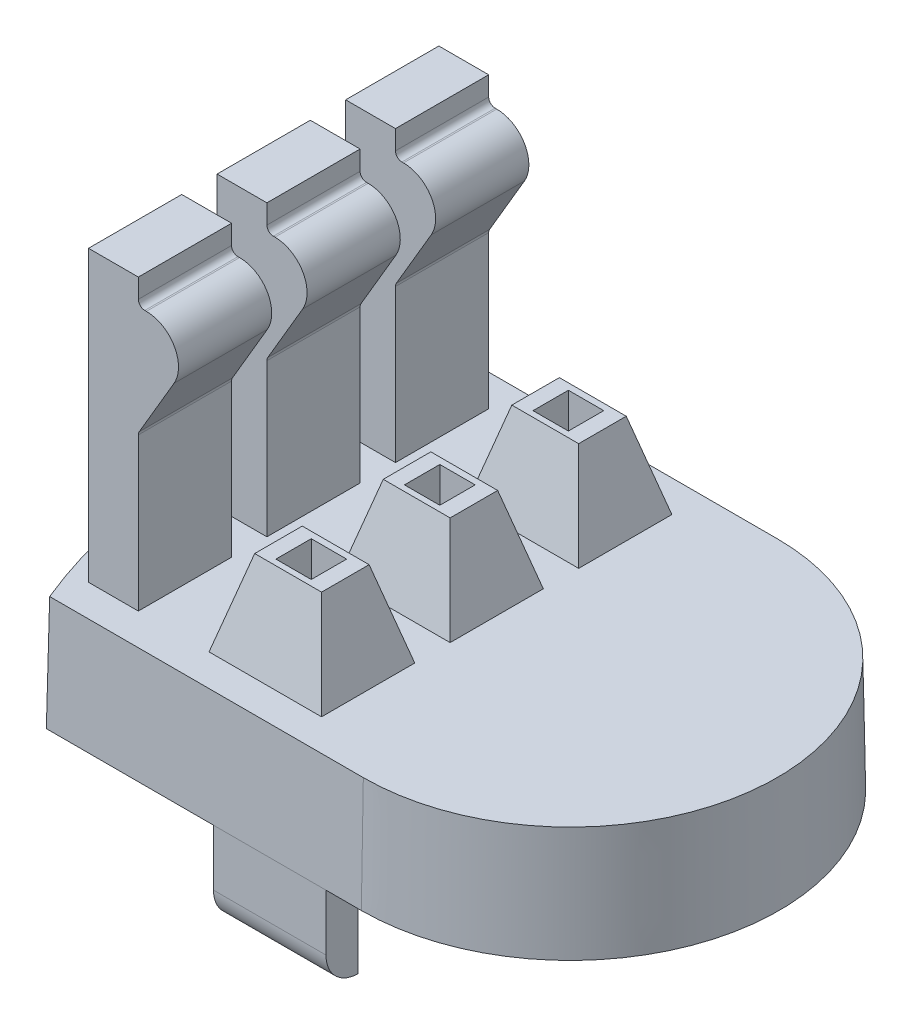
ISO-10303-21;
HEADER;
FILE_DESCRIPTION(('STEP AP214'),'2;1');
FILE_NAME('part.step','',(''),(''),'','','');
FILE_SCHEMA(('AUTOMOTIVE_DESIGN { 1 0 10303 214 1 1 1 1 }'));
ENDSEC;
DATA;
#1=APPLICATION_CONTEXT('core data for automotive mechanical design processes');
#2=APPLICATION_PROTOCOL_DEFINITION('international standard','automotive_design',2000,#1);
#3=PRODUCT_CONTEXT('',#1,'mechanical');
#4=PRODUCT('Part','Part','',(#3));
#5=PRODUCT_RELATED_PRODUCT_CATEGORY('part','',(#4));
#6=PRODUCT_DEFINITION_FORMATION('','',#4);
#7=PRODUCT_DEFINITION_CONTEXT('part definition',#1,'design');
#8=PRODUCT_DEFINITION('design','',#6,#7);
#9=PRODUCT_DEFINITION_SHAPE('','',#8);
#10=(LENGTH_UNIT() NAMED_UNIT(*) SI_UNIT(.MILLI.,.METRE.));
#11=(NAMED_UNIT(*) PLANE_ANGLE_UNIT() SI_UNIT($,.RADIAN.));
#12=(NAMED_UNIT(*) SI_UNIT($,.STERADIAN.) SOLID_ANGLE_UNIT());
#13=UNCERTAINTY_MEASURE_WITH_UNIT(LENGTH_MEASURE(1.E-05),#10,'distance_accuracy_value','');
#14=(GEOMETRIC_REPRESENTATION_CONTEXT(3) GLOBAL_UNCERTAINTY_ASSIGNED_CONTEXT((#13)) GLOBAL_UNIT_ASSIGNED_CONTEXT((#10,
#11,#12)) REPRESENTATION_CONTEXT('',''));
#15=CARTESIAN_POINT('',(0.,0.,0.));
#16=DIRECTION('',(0.,0.,1.));
#17=DIRECTION('',(1.,0.,0.));
#18=AXIS2_PLACEMENT_3D('',#15,#16,#17);
#19=CARTESIAN_POINT('',(0.,0.,0.));
#20=DIRECTION('',(0.,1.,0.));
#21=DIRECTION('',(0.,0.,1.));
#22=AXIS2_PLACEMENT_3D('',#19,#20,#21);
#23=PLANE('',#22);
#24=DIRECTION('',(1.,0.,0.));
#25=VECTOR('',#24,1.);
#26=CARTESIAN_POINT('',(0.,0.,-5.49984767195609));
#27=LINE('',#26,#25);
#28=CARTESIAN_POINT('',(0.,0.,-5.49984767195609));
#29=VERTEX_POINT('',#28);
#30=CARTESIAN_POINT('',(-7.41663626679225,0.,-5.49984767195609));
#31=VERTEX_POINT('',#30);
#32=EDGE_CURVE('E1225',#29,#31,#27,.F.);
#33=ORIENTED_EDGE('',*,*,#32,.T.);
#34=CARTESIAN_POINT('',(5.89996592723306,0.,-0.0200513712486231));
#35=DIRECTION('',(0.,1.,0.));
#36=DIRECTION('',(0.,0.,1.));
#37=AXIS2_PLACEMENT_3D('',#34,#35,#36);
#38=CIRCLE('',#37,14.4000021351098);
#39=CARTESIAN_POINT('',(-7.4000632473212,0.,5.49984767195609));
#40=VERTEX_POINT('',#39);
#41=EDGE_CURVE('E1091',#40,#31,#38,.F.);
#42=ORIENTED_EDGE('',*,*,#41,.F.);
#43=DIRECTION('',(-1.,0.,0.));
#44=VECTOR('',#43,1.);
#45=CARTESIAN_POINT('',(0.,0.,5.49984767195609));
#46=LINE('',#45,#44);
#47=CARTESIAN_POINT('',(0.,0.,5.49984767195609));
#48=VERTEX_POINT('',#47);
#49=EDGE_CURVE('E1223',#40,#48,#46,.F.);
#50=ORIENTED_EDGE('',*,*,#49,.T.);
#51=CARTESIAN_POINT('',(0.,0.,0.));
#52=DIRECTION('',(0.,1.,0.));
#53=DIRECTION('',(0.,0.,1.));
#54=AXIS2_PLACEMENT_3D('',#51,#52,#53);
#55=CIRCLE('',#54,5.49984767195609);
#56=EDGE_CURVE('E712',#48,#29,#55,.T.);
#57=ORIENTED_EDGE('',*,*,#56,.T.);
#58=EDGE_LOOP('',(#33,#42,#50,#57));
#59=FACE_BOUND('',#58,.T.);
#60=CARTESIAN_POINT('',(-9.11755184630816,0.,5.49984767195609));
#61=VERTEX_POINT('',#60);
#62=CARTESIAN_POINT('',(-8.20865761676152,0.,5.49984767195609));
#63=VERTEX_POINT('',#62);
#64=EDGE_CURVE('E705',#61,#63,#46,.F.);
#65=ORIENTED_EDGE('',*,*,#64,.T.);
#66=CARTESIAN_POINT('',(5.89996592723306,0.,-0.0200513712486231));
#67=DIRECTION('',(0.,1.,0.));
#68=DIRECTION('',(0.,0.,1.));
#69=AXIS2_PLACEMENT_3D('',#66,#67,#68);
#70=CIRCLE('',#69,15.1500014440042);
#71=CARTESIAN_POINT('',(-8.22428188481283,0.,-5.49984767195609));
#72=VERTEX_POINT('',#71);
#73=EDGE_CURVE('E1088',#72,#63,#70,.T.);
#74=ORIENTED_EDGE('',*,*,#73,.F.);
#75=CARTESIAN_POINT('',(-9.13223145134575,0.,-5.49984767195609));
#76=VERTEX_POINT('',#75);
#77=EDGE_CURVE('E1220',#72,#76,#27,.F.);
#78=ORIENTED_EDGE('',*,*,#77,.T.);
#79=CARTESIAN_POINT('',(5.89996592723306,0.,-0.0200513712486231));
#80=DIRECTION('',(0.,1.,0.));
#81=DIRECTION('',(0.,0.,1.));
#82=AXIS2_PLACEMENT_3D('',#79,#80,#81);
#83=CIRCLE('',#82,15.9998476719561);
#84=EDGE_CURVE('E1212',#76,#61,#83,.T.);
#85=ORIENTED_EDGE('',*,*,#84,.T.);
#86=EDGE_LOOP('',(#65,#74,#78,#85));
#87=FACE_BOUND('',#86,.T.);
#88=DIRECTION('',(0.,0.,1.));
#89=VECTOR('',#88,1.);
#90=CARTESIAN_POINT('',(-1.10002022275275,0.,-6.5));
#91=LINE('',#90,#89);
#92=CARTESIAN_POINT('',(-1.10002022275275,0.,-6.5));
#93=VERTEX_POINT('',#92);
#94=CARTESIAN_POINT('',(-1.10002022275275,0.,-5.5));
#95=VERTEX_POINT('',#94);
#96=EDGE_CURVE('E539',#93,#95,#91,.T.);
#97=ORIENTED_EDGE('',*,*,#96,.F.);
#98=DIRECTION('',(-1.,0.,0.));
#99=VECTOR('',#98,1.);
#100=CARTESIAN_POINT('',(0.,0.,-6.5));
#101=LINE('',#100,#99);
#102=CARTESIAN_POINT('',(0.,0.,-6.5));
#103=VERTEX_POINT('',#102);
#104=EDGE_CURVE('E1228',#103,#93,#101,.T.);
#105=ORIENTED_EDGE('',*,*,#104,.F.);
#106=CARTESIAN_POINT('',(0.,0.,0.));
#107=DIRECTION('',(0.,1.,0.));
#108=DIRECTION('',(0.,0.,1.));
#109=AXIS2_PLACEMENT_3D('',#106,#107,#108);
#110=CIRCLE('',#109,6.5);
#111=CARTESIAN_POINT('',(0.,0.,6.5));
#112=VERTEX_POINT('',#111);
#113=EDGE_CURVE('E708',#112,#103,#110,.T.);
#114=ORIENTED_EDGE('',*,*,#113,.F.);
#115=DIRECTION('',(1.,0.,0.));
#116=VECTOR('',#115,1.);
#117=CARTESIAN_POINT('',(0.,0.,6.5));
#118=LINE('',#117,#116);
#119=CARTESIAN_POINT('',(-1.10002022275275,0.,6.5));
#120=VERTEX_POINT('',#119);
#121=EDGE_CURVE('E581',#120,#112,#118,.T.);
#122=ORIENTED_EDGE('',*,*,#121,.F.);
#123=DIRECTION('',(0.,0.,1.));
#124=VECTOR('',#123,1.);
#125=CARTESIAN_POINT('',(-1.10002022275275,0.,6.5));
#126=LINE('',#125,#124);
#127=CARTESIAN_POINT('',(-1.10002022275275,0.,5.5));
#128=VERTEX_POINT('',#127);
#129=EDGE_CURVE('E541',#128,#120,#126,.T.);
#130=ORIENTED_EDGE('',*,*,#129,.F.);
#131=DIRECTION('',(1.,0.,0.));
#132=VECTOR('',#131,1.);
#133=CARTESIAN_POINT('',(-1.10002022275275,0.,5.5));
#134=LINE('',#133,#132);
#135=CARTESIAN_POINT('',(-4.60002022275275,0.,5.5));
#136=VERTEX_POINT('',#135);
#137=EDGE_CURVE('E554',#136,#128,#134,.T.);
#138=ORIENTED_EDGE('',*,*,#137,.F.);
#139=DIRECTION('',(0.,0.,-1.));
#140=VECTOR('',#139,1.);
#141=CARTESIAN_POINT('',(-4.60002022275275,0.,6.5));
#142=LINE('',#141,#140);
#143=CARTESIAN_POINT('',(-4.60002022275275,0.,6.5));
#144=VERTEX_POINT('',#143);
#145=EDGE_CURVE('E576',#144,#136,#142,.T.);
#146=ORIENTED_EDGE('',*,*,#145,.F.);
#147=CARTESIAN_POINT('',(-9.8,0.,6.5));
#148=VERTEX_POINT('',#147);
#149=EDGE_CURVE('E584',#148,#144,#118,.T.);
#150=ORIENTED_EDGE('',*,*,#149,.F.);
#151=CARTESIAN_POINT('',(5.89996592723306,0.,-0.0200513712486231));
#152=DIRECTION('',(0.,1.,0.));
#153=DIRECTION('',(0.,0.,1.));
#154=AXIS2_PLACEMENT_3D('',#151,#152,#153);
#155=CIRCLE('',#154,17.);
#156=CARTESIAN_POINT('',(-9.8165943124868,0.,-6.5));
#157=VERTEX_POINT('',#156);
#158=EDGE_CURVE('E585',#157,#148,#155,.T.);
#159=ORIENTED_EDGE('',*,*,#158,.F.);
#160=CARTESIAN_POINT('',(-4.60002022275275,0.,-6.5));
#161=VERTEX_POINT('',#160);
#162=EDGE_CURVE('E1227',#161,#157,#101,.T.);
#163=ORIENTED_EDGE('',*,*,#162,.F.);
#164=DIRECTION('',(0.,0.,-1.));
#165=VECTOR('',#164,1.);
#166=CARTESIAN_POINT('',(-4.60002022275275,0.,-6.5));
#167=LINE('',#166,#165);
#168=CARTESIAN_POINT('',(-4.60002022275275,0.,-5.5));
#169=VERTEX_POINT('',#168);
#170=EDGE_CURVE('E2218',#169,#161,#167,.T.);
#171=ORIENTED_EDGE('',*,*,#170,.F.);
#172=DIRECTION('',(-1.,0.,0.));
#173=VECTOR('',#172,1.);
#174=CARTESIAN_POINT('',(-1.10002022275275,0.,-5.5));
#175=LINE('',#174,#173);
#176=EDGE_CURVE('E2223',#95,#169,#175,.T.);
#177=ORIENTED_EDGE('',*,*,#176,.F.);
#178=EDGE_LOOP('',(#97,#105,#114,#122,#130,#138,#146,#150,#159,#163,#171,#177));
#179=FACE_BOUND('',#178,.T.);
#180=ADVANCED_FACE('F33',(#59,#87,#179),#23,.F.);
#181=CARTESIAN_POINT('',(0.,2.55,0.));
#182=DIRECTION('',(0.,1.,0.));
#183=DIRECTION('',(0.,0.,1.));
#184=AXIS2_PLACEMENT_3D('',#181,#182,#183);
#185=PLANE('',#184);
#186=CARTESIAN_POINT('',(5.89996592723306,2.55,-0.0200513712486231));
#187=DIRECTION('',(0.,1.,0.));
#188=DIRECTION('',(0.,0.,1.));
#189=AXIS2_PLACEMENT_3D('',#186,#187,#188);
#190=CIRCLE('',#189,14.4000021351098);
#191=CARTESIAN_POINT('',(-7.43486548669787,2.55,-5.45533725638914));
#192=VERTEX_POINT('',#191);
#193=CARTESIAN_POINT('',(-7.41844917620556,2.55,5.45533725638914));
#194=VERTEX_POINT('',#193);
#195=EDGE_CURVE('E525',#192,#194,#190,.T.);
#196=ORIENTED_EDGE('',*,*,#195,.F.);
#197=DIRECTION('',(1.,0.,0.));
#198=VECTOR('',#197,1.);
#199=CARTESIAN_POINT('',(0.,2.55,-5.45533725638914));
#200=LINE('',#199,#198);
#201=CARTESIAN_POINT('',(0.,2.55,-5.45533725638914));
#202=VERTEX_POINT('',#201);
#203=EDGE_CURVE('E681',#202,#192,#200,.F.);
#204=ORIENTED_EDGE('',*,*,#203,.F.);
#205=CARTESIAN_POINT('',(0.,2.55,0.));
#206=DIRECTION('',(0.,1.,0.));
#207=DIRECTION('',(0.,0.,1.));
#208=AXIS2_PLACEMENT_3D('',#205,#206,#207);
#209=CIRCLE('',#208,5.45533725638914);
#210=CARTESIAN_POINT('',(0.,2.55,5.45533725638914));
#211=VERTEX_POINT('',#210);
#212=EDGE_CURVE('E701',#211,#202,#209,.T.);
#213=ORIENTED_EDGE('',*,*,#212,.F.);
#214=DIRECTION('',(-1.,0.,0.));
#215=VECTOR('',#214,1.);
#216=CARTESIAN_POINT('',(0.,2.55,5.45533725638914));
#217=LINE('',#216,#215);
#218=EDGE_CURVE('E1201',#194,#211,#217,.F.);
#219=ORIENTED_EDGE('',*,*,#218,.F.);
#220=EDGE_LOOP('',(#196,#204,#213,#219));
#221=FACE_BOUND('',#220,.T.);
#222=DIRECTION('',(0.,0.,1.));
#223=VECTOR('',#222,1.);
#224=CARTESIAN_POINT('',(-4.59813395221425,2.55,0.));
#225=LINE('',#224,#223);
#226=CARTESIAN_POINT('',(-4.59813395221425,2.55,-4.53993464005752));
#227=VERTEX_POINT('',#226);
#228=CARTESIAN_POINT('',(-4.59813395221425,2.55,-3.43993464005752));
#229=VERTEX_POINT('',#228);
#230=EDGE_CURVE('E1038',#227,#229,#225,.T.);
#231=ORIENTED_EDGE('',*,*,#230,.T.);
#232=DIRECTION('',(1.,0.,0.));
#233=VECTOR('',#232,1.);
#234=CARTESIAN_POINT('',(0.,2.55,-3.43993464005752));
#235=LINE('',#234,#233);
#236=CARTESIAN_POINT('',(-3.49813395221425,2.55,-3.43993464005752));
#237=VERTEX_POINT('',#236);
#238=EDGE_CURVE('E1035',#229,#237,#235,.T.);
#239=ORIENTED_EDGE('',*,*,#238,.T.);
#240=DIRECTION('',(0.,0.,-1.));
#241=VECTOR('',#240,1.);
#242=CARTESIAN_POINT('',(-3.49813395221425,2.55,0.));
#243=LINE('',#242,#241);
#244=CARTESIAN_POINT('',(-3.49813395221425,2.55,-4.53993464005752));
#245=VERTEX_POINT('',#244);
#246=EDGE_CURVE('E1044',#237,#245,#243,.T.);
#247=ORIENTED_EDGE('',*,*,#246,.T.);
#248=DIRECTION('',(-1.,0.,0.));
#249=VECTOR('',#248,1.);
#250=CARTESIAN_POINT('',(0.,2.55,-4.53993464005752));
#251=LINE('',#250,#249);
#252=EDGE_CURVE('E1041',#245,#227,#251,.T.);
#253=ORIENTED_EDGE('',*,*,#252,.T.);
#254=EDGE_LOOP('',(#231,#239,#247,#253));
#255=FACE_BOUND('',#254,.T.);
#256=DIRECTION('',(0.,0.,1.));
#257=VECTOR('',#256,1.);
#258=CARTESIAN_POINT('',(-4.59813395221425,2.55,0.));
#259=LINE('',#258,#257);
#260=CARTESIAN_POINT('',(-4.59813395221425,2.55,3.46006535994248));
#261=VERTEX_POINT('',#260);
#262=CARTESIAN_POINT('',(-4.59813395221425,2.55,4.56006535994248));
#263=VERTEX_POINT('',#262);
#264=EDGE_CURVE('E1006',#261,#263,#259,.T.);
#265=ORIENTED_EDGE('',*,*,#264,.T.);
#266=DIRECTION('',(1.,0.,0.));
#267=VECTOR('',#266,1.);
#268=CARTESIAN_POINT('',(0.,2.55,4.56006535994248));
#269=LINE('',#268,#267);
#270=CARTESIAN_POINT('',(-3.49813395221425,2.55,4.56006535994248));
#271=VERTEX_POINT('',#270);
#272=EDGE_CURVE('E1003',#263,#271,#269,.T.);
#273=ORIENTED_EDGE('',*,*,#272,.T.);
#274=DIRECTION('',(0.,0.,-1.));
#275=VECTOR('',#274,1.);
#276=CARTESIAN_POINT('',(-3.49813395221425,2.55,0.));
#277=LINE('',#276,#275);
#278=CARTESIAN_POINT('',(-3.49813395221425,2.55,3.46006535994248));
#279=VERTEX_POINT('',#278);
#280=EDGE_CURVE('E1012',#271,#279,#277,.T.);
#281=ORIENTED_EDGE('',*,*,#280,.T.);
#282=DIRECTION('',(-1.,0.,0.));
#283=VECTOR('',#282,1.);
#284=CARTESIAN_POINT('',(0.,2.55,3.46006535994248));
#285=LINE('',#284,#283);
#286=EDGE_CURVE('E1009',#279,#261,#285,.T.);
#287=ORIENTED_EDGE('',*,*,#286,.T.);
#288=EDGE_LOOP('',(#265,#273,#281,#287));
#289=FACE_BOUND('',#288,.T.);
#290=DIRECTION('',(0.,0.,1.));
#291=VECTOR('',#290,1.);
#292=CARTESIAN_POINT('',(-4.59813395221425,2.55,0.));
#293=LINE('',#292,#291);
#294=CARTESIAN_POINT('',(-4.59813395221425,2.55,-0.539934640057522));
#295=VERTEX_POINT('',#294);
#296=CARTESIAN_POINT('',(-4.59813395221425,2.55,0.560065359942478));
#297=VERTEX_POINT('',#296);
#298=EDGE_CURVE('E928',#295,#297,#293,.T.);
#299=ORIENTED_EDGE('',*,*,#298,.T.);
#300=DIRECTION('',(1.,0.,0.));
#301=VECTOR('',#300,1.);
#302=CARTESIAN_POINT('',(0.,2.55,0.560065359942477));
#303=LINE('',#302,#301);
#304=CARTESIAN_POINT('',(-3.49813395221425,2.55,0.560065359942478));
#305=VERTEX_POINT('',#304);
#306=EDGE_CURVE('E925',#297,#305,#303,.T.);
#307=ORIENTED_EDGE('',*,*,#306,.T.);
#308=DIRECTION('',(0.,0.,-1.));
#309=VECTOR('',#308,1.);
#310=CARTESIAN_POINT('',(-3.49813395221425,2.55,0.));
#311=LINE('',#310,#309);
#312=CARTESIAN_POINT('',(-3.49813395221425,2.55,-0.539934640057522));
#313=VERTEX_POINT('',#312);
#314=EDGE_CURVE('E934',#305,#313,#311,.T.);
#315=ORIENTED_EDGE('',*,*,#314,.T.);
#316=DIRECTION('',(-1.,0.,0.));
#317=VECTOR('',#316,1.);
#318=CARTESIAN_POINT('',(0.,2.55,-0.539934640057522));
#319=LINE('',#318,#317);
#320=EDGE_CURVE('E931',#313,#295,#319,.T.);
#321=ORIENTED_EDGE('',*,*,#320,.T.);
#322=EDGE_LOOP('',(#299,#307,#315,#321));
#323=FACE_BOUND('',#322,.T.);
#324=DIRECTION('',(0.,0.,1.));
#325=VECTOR('',#324,1.);
#326=CARTESIAN_POINT('',(-0.650000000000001,2.55,4.));
#327=LINE('',#326,#325);
#328=CARTESIAN_POINT('',(-0.65,2.55,-4.));
#329=VERTEX_POINT('',#328);
#330=CARTESIAN_POINT('',(-0.650000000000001,2.55,4.));
#331=VERTEX_POINT('',#330);
#332=EDGE_CURVE('E1117',#329,#331,#327,.T.);
#333=ORIENTED_EDGE('',*,*,#332,.F.);
#334=DIRECTION('',(1.,0.,0.));
#335=VECTOR('',#334,1.);
#336=CARTESIAN_POINT('',(-0.65,2.55,-4.));
#337=LINE('',#336,#335);
#338=CARTESIAN_POINT('',(-1.5,2.55,-4.));
#339=VERTEX_POINT('',#338);
#340=EDGE_CURVE('E1107',#339,#329,#337,.T.);
#341=ORIENTED_EDGE('',*,*,#340,.F.);
#342=DIRECTION('',(0.,0.,-1.));
#343=VECTOR('',#342,1.);
#344=CARTESIAN_POINT('',(-1.5,2.55,4.));
#345=LINE('',#344,#343);
#346=CARTESIAN_POINT('',(-1.5,2.55,4.));
#347=VERTEX_POINT('',#346);
#348=EDGE_CURVE('E1111',#347,#339,#345,.T.);
#349=ORIENTED_EDGE('',*,*,#348,.F.);
#350=DIRECTION('',(-1.,0.,0.));
#351=VECTOR('',#350,1.);
#352=CARTESIAN_POINT('',(-0.650000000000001,2.55,4.));
#353=LINE('',#352,#351);
#354=EDGE_CURVE('E1114',#331,#347,#353,.T.);
#355=ORIENTED_EDGE('',*,*,#354,.F.);
#356=EDGE_LOOP('',(#333,#341,#349,#355));
#357=FACE_BOUND('',#356,.T.);
#358=ADVANCED_FACE('F642',(#221,#255,#289,#323,#357),#185,.F.);
#359=CARTESIAN_POINT('',(0.,-0.0174524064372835,-5.50015230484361));
#360=DIRECTION('',(0.,0.0174524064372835,-0.999847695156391));
#361=DIRECTION('',(0.,0.999847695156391,0.0174524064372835));
#362=AXIS2_PLACEMENT_3D('',#359,#360,#361);
#363=PLANE('',#362);
#364=ORIENTED_EDGE('',*,*,#203,.T.);
#365=CARTESIAN_POINT('',(5.89996592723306,313.937319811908,-0.0200513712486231));
#366=DIRECTION('',(0.,0.0174524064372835,-0.999847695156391));
#367=DIRECTION('',(0.,0.999847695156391,0.0174524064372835));
#368=AXIS2_PLACEMENT_3D('',#365,#366,#367);
#369=ELLIPSE('',#368,825.101236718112,14.4000021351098);
#370=EDGE_CURVE('E1079',#192,#31,#369,.F.);
#371=ORIENTED_EDGE('',*,*,#370,.T.);
#372=ORIENTED_EDGE('',*,*,#32,.F.);
#373=DIRECTION('',(0.,0.999847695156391,0.0174524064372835));
#374=VECTOR('',#373,1.);
#375=CARTESIAN_POINT('',(0.,-0.0174524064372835,-5.50015230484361));
#376=LINE('',#375,#374);
#377=EDGE_CURVE('E697',#202,#29,#376,.F.);
#378=ORIENTED_EDGE('',*,*,#377,.F.);
#379=EDGE_LOOP('',(#364,#371,#372,#378));
#380=FACE_BOUND('',#379,.T.);
#381=ADVANCED_FACE('F647',(#380),#363,.F.);
#382=ORIENTED_EDGE('',*,*,#77,.F.);
#383=CARTESIAN_POINT('',(5.89996592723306,313.937319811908,-0.0200513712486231));
#384=DIRECTION('',(0.,0.0174524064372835,-0.999847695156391));
#385=DIRECTION('',(0.,0.999847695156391,0.0174524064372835));
#386=AXIS2_PLACEMENT_3D('',#383,#384,#385);
#387=ELLIPSE('',#386,868.075213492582,15.1500014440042);
#388=CARTESIAN_POINT('',(-8.2414700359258,2.55,-5.45533725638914));
#389=VERTEX_POINT('',#388);
#390=EDGE_CURVE('E1083',#72,#389,#387,.T.);
#391=ORIENTED_EDGE('',*,*,#390,.T.);
#392=CARTESIAN_POINT('',(-9.10104918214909,2.55,-5.45533725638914));
#393=VERTEX_POINT('',#392);
#394=EDGE_CURVE('E704',#389,#393,#200,.F.);
#395=ORIENTED_EDGE('',*,*,#394,.T.);
#396=CARTESIAN_POINT('',(-9.10104918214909,2.55,-5.45533725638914));
#397=CARTESIAN_POINT('',(-9.10625162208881,2.12500006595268,-5.46275565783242));
#398=CARTESIAN_POINT('',(-9.11145136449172,1.70000009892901,-5.47017405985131));
#399=CARTESIAN_POINT('',(-9.12184545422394,0.850000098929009,-5.48501086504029));
#400=CARTESIAN_POINT('',(-9.12703980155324,0.425000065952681,-5.49242926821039));
#401=CARTESIAN_POINT('',(-9.13223145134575,0.,-5.49984767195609));
#402=B_SPLINE_CURVE_WITH_KNOTS('',3,(#396,#397,#398,#399,#400,#401),.UNSPECIFIED.,.F.,.F.,(4,2,
4),(0.,1.27528952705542,2.55057905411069),.UNSPECIFIED.);
#403=EDGE_CURVE('E679',#393,#76,#402,.T.);
#404=ORIENTED_EDGE('',*,*,#403,.T.);
#405=EDGE_LOOP('',(#382,#391,#395,#404));
#406=FACE_BOUND('',#405,.T.);
#407=ADVANCED_FACE('F668',(#406),#363,.F.);
#408=CARTESIAN_POINT('',(0.,-0.0174524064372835,5.50015230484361));
#409=DIRECTION('',(0.,0.0174524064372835,0.999847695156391));
#410=DIRECTION('',(0.,-0.999847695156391,0.0174524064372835));
#411=AXIS2_PLACEMENT_3D('',#408,#409,#410);
#412=PLANE('',#411);
#413=ORIENTED_EDGE('',*,*,#49,.F.);
#414=CARTESIAN_POINT('',(5.89996592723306,316.234804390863,-0.0200513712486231));
#415=DIRECTION('',(0.,0.0174524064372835,0.999847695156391));
#416=DIRECTION('',(0.,0.999847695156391,-0.0174524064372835));
#417=AXIS2_PLACEMENT_3D('',#414,#415,#416);
#418=ELLIPSE('',#417,825.101236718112,14.4000021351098);
#419=EDGE_CURVE('E1081',#40,#194,#418,.F.);
#420=ORIENTED_EDGE('',*,*,#419,.T.);
#421=ORIENTED_EDGE('',*,*,#218,.T.);
#422=DIRECTION('',(0.,-0.999847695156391,0.0174524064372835));
#423=VECTOR('',#422,1.);
#424=CARTESIAN_POINT('',(0.,-0.0174524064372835,5.50015230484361));
#425=LINE('',#424,#423);
#426=EDGE_CURVE('E680',#211,#48,#425,.T.);
#427=ORIENTED_EDGE('',*,*,#426,.T.);
#428=EDGE_LOOP('',(#413,#420,#421,#427));
#429=FACE_BOUND('',#428,.T.);
#430=ADVANCED_FACE('F663',(#429),#412,.F.);
#431=CARTESIAN_POINT('',(-9.08645814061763,2.55,5.45533725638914));
#432=VERTEX_POINT('',#431);
#433=CARTESIAN_POINT('',(-8.22599114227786,2.55,5.45533725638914));
#434=VERTEX_POINT('',#433);
#435=EDGE_CURVE('E700',#432,#434,#217,.F.);
#436=ORIENTED_EDGE('',*,*,#435,.T.);
#437=CARTESIAN_POINT('',(5.89996592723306,316.234804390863,-0.0200513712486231));
#438=DIRECTION('',(0.,0.0174524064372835,0.999847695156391));
#439=DIRECTION('',(0.,0.999847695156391,-0.0174524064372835));
#440=AXIS2_PLACEMENT_3D('',#437,#438,#439);
#441=ELLIPSE('',#440,868.075213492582,15.1500014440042);
#442=EDGE_CURVE('E1086',#434,#63,#441,.T.);
#443=ORIENTED_EDGE('',*,*,#442,.T.);
#444=ORIENTED_EDGE('',*,*,#64,.F.);
#445=CARTESIAN_POINT('',(-9.08645814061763,2.55,5.45533725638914));
#446=CARTESIAN_POINT('',(-9.09164579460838,2.12500006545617,5.46275565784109));
#447=CARTESIAN_POINT('',(-9.09683076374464,1.70000009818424,5.47017405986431));
#448=CARTESIAN_POINT('',(-9.10719533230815,0.850000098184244,5.48501086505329));
#449=CARTESIAN_POINT('',(-9.11237493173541,0.425000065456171,5.49242926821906));
#450=CARTESIAN_POINT('',(-9.11755184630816,0.,5.49984767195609));
#451=B_SPLINE_CURVE_WITH_KNOTS('',3,(#445,#446,#447,#448,#449,#450),.UNSPECIFIED.,.F.,.F.,(4,2,
4),(0.,1.27528898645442,2.5505779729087),.UNSPECIFIED.);
#452=EDGE_CURVE('E673',#432,#61,#451,.T.);
#453=ORIENTED_EDGE('',*,*,#452,.F.);
#454=EDGE_LOOP('',(#436,#443,#444,#453));
#455=FACE_BOUND('',#454,.T.);
#456=ADVANCED_FACE('F667',(#455),#412,.F.);
#457=CARTESIAN_POINT('',(5.89996592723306,2.55,-0.0200513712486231));
#458=DIRECTION('',(0.,1.,0.));
#459=DIRECTION('',(0.,0.,1.));
#460=AXIS2_PLACEMENT_3D('',#457,#458,#459);
#461=CIRCLE('',#460,15.1500014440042);
#462=EDGE_CURVE('E1189',#434,#389,#461,.F.);
#463=ORIENTED_EDGE('',*,*,#462,.F.);
#464=ORIENTED_EDGE('',*,*,#435,.F.);
#465=CARTESIAN_POINT('',(5.89996592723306,2.55,-0.0200513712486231));
#466=DIRECTION('',(0.,1.,0.));
#467=DIRECTION('',(0.,0.,1.));
#468=AXIS2_PLACEMENT_3D('',#465,#466,#467);
#469=CIRCLE('',#468,15.9553372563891);
#470=EDGE_CURVE('E683',#393,#432,#469,.T.);
#471=ORIENTED_EDGE('',*,*,#470,.F.);
#472=ORIENTED_EDGE('',*,*,#394,.F.);
#473=EDGE_LOOP('',(#463,#464,#471,#472));
#474=FACE_BOUND('',#473,.T.);
#475=ADVANCED_FACE('F650',(#474),#185,.F.);
#476=CARTESIAN_POINT('',(-4.59813395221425,0.,0.560065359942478));
#477=DIRECTION('',(0.,0.,1.));
#478=DIRECTION('',(1.,0.,0.));
#479=AXIS2_PLACEMENT_3D('',#476,#477,#478);
#480=PLANE('',#479);
#481=DIRECTION('',(0.,1.,0.));
#482=VECTOR('',#481,1.);
#483=CARTESIAN_POINT('',(-4.59813395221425,0.,0.560065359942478));
#484=LINE('',#483,#482);
#485=CARTESIAN_POINT('',(-4.59813395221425,6.2,0.560065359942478));
#486=VERTEX_POINT('',#485);
#487=EDGE_CURVE('E937',#297,#486,#484,.T.);
#488=ORIENTED_EDGE('',*,*,#487,.T.);
#489=DIRECTION('',(1.,0.,0.));
#490=VECTOR('',#489,1.);
#491=CARTESIAN_POINT('',(-4.59813395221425,6.2,0.560065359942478));
#492=LINE('',#491,#490);
#493=CARTESIAN_POINT('',(-3.49813395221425,6.2,0.560065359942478));
#494=VERTEX_POINT('',#493);
#495=EDGE_CURVE('E1076',#486,#494,#492,.T.);
#496=ORIENTED_EDGE('',*,*,#495,.T.);
#497=DIRECTION('',(0.,1.,0.));
#498=VECTOR('',#497,1.);
#499=CARTESIAN_POINT('',(-3.49813395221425,0.,0.560065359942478));
#500=LINE('',#499,#498);
#501=EDGE_CURVE('E938',#305,#494,#500,.T.);
#502=ORIENTED_EDGE('',*,*,#501,.F.);
#503=ORIENTED_EDGE('',*,*,#306,.F.);
#504=EDGE_LOOP('',(#488,#496,#502,#503));
#505=FACE_BOUND('',#504,.T.);
#506=ADVANCED_FACE('F1305',(#505),#480,.F.);
#507=CARTESIAN_POINT('',(-4.59813395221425,0.,-0.539934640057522));
#508=DIRECTION('',(-1.,0.,0.));
#509=DIRECTION('',(0.,0.,1.));
#510=AXIS2_PLACEMENT_3D('',#507,#508,#509);
#511=PLANE('',#510);
#512=DIRECTION('',(0.,1.,0.));
#513=VECTOR('',#512,1.);
#514=CARTESIAN_POINT('',(-4.59813395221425,0.,-0.539934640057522));
#515=LINE('',#514,#513);
#516=CARTESIAN_POINT('',(-4.59813395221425,6.2,-0.539934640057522));
#517=VERTEX_POINT('',#516);
#518=EDGE_CURVE('E943',#295,#517,#515,.T.);
#519=ORIENTED_EDGE('',*,*,#518,.T.);
#520=DIRECTION('',(0.,0.,1.));
#521=VECTOR('',#520,1.);
#522=CARTESIAN_POINT('',(-4.59813395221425,6.2,-0.539934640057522));
#523=LINE('',#522,#521);
#524=EDGE_CURVE('E1067',#517,#486,#523,.T.);
#525=ORIENTED_EDGE('',*,*,#524,.T.);
#526=ORIENTED_EDGE('',*,*,#487,.F.);
#527=ORIENTED_EDGE('',*,*,#298,.F.);
#528=EDGE_LOOP('',(#519,#525,#526,#527));
#529=FACE_BOUND('',#528,.T.);
#530=ADVANCED_FACE('F1301',(#529),#511,.F.);
#531=CARTESIAN_POINT('',(-3.49813395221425,0.,-0.539934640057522));
#532=DIRECTION('',(0.,0.,-1.));
#533=DIRECTION('',(-1.,0.,0.));
#534=AXIS2_PLACEMENT_3D('',#531,#532,#533);
#535=PLANE('',#534);
#536=DIRECTION('',(0.,1.,0.));
#537=VECTOR('',#536,1.);
#538=CARTESIAN_POINT('',(-3.49813395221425,0.,-0.539934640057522));
#539=LINE('',#538,#537);
#540=CARTESIAN_POINT('',(-3.49813395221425,6.2,-0.539934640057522));
#541=VERTEX_POINT('',#540);
#542=EDGE_CURVE('E940',#313,#541,#539,.T.);
#543=ORIENTED_EDGE('',*,*,#542,.T.);
#544=DIRECTION('',(-1.,0.,0.));
#545=VECTOR('',#544,1.);
#546=CARTESIAN_POINT('',(-3.49813395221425,6.2,-0.539934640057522));
#547=LINE('',#546,#545);
#548=EDGE_CURVE('E1070',#541,#517,#547,.T.);
#549=ORIENTED_EDGE('',*,*,#548,.T.);
#550=ORIENTED_EDGE('',*,*,#518,.F.);
#551=ORIENTED_EDGE('',*,*,#320,.F.);
#552=EDGE_LOOP('',(#543,#549,#550,#551));
#553=FACE_BOUND('',#552,.T.);
#554=ADVANCED_FACE('F1304',(#553),#535,.F.);
#555=CARTESIAN_POINT('',(-3.49813395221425,0.,0.560065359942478));
#556=DIRECTION('',(1.,0.,0.));
#557=DIRECTION('',(0.,0.,-1.));
#558=AXIS2_PLACEMENT_3D('',#555,#556,#557);
#559=PLANE('',#558);
#560=ORIENTED_EDGE('',*,*,#501,.T.);
#561=DIRECTION('',(0.,0.,-1.));
#562=VECTOR('',#561,1.);
#563=CARTESIAN_POINT('',(-3.49813395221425,6.2,0.560065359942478));
#564=LINE('',#563,#562);
#565=EDGE_CURVE('E1073',#494,#541,#564,.T.);
#566=ORIENTED_EDGE('',*,*,#565,.T.);
#567=ORIENTED_EDGE('',*,*,#542,.F.);
#568=ORIENTED_EDGE('',*,*,#314,.F.);
#569=EDGE_LOOP('',(#560,#566,#567,#568));
#570=FACE_BOUND('',#569,.T.);
#571=ADVANCED_FACE('F655',(#570),#559,.F.);
#572=CARTESIAN_POINT('',(0.,3.55,0.));
#573=DIRECTION('',(0.,1.,0.));
#574=DIRECTION('',(0.,0.,1.));
#575=AXIS2_PLACEMENT_3D('',#572,#573,#574);
#576=PLANE('',#575);
#577=DIRECTION('',(1.,0.,0.));
#578=VECTOR('',#577,1.);
#579=CARTESIAN_POINT('',(-5.78806859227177,3.55,5.45));
#580=LINE('',#579,#578);
#581=CARTESIAN_POINT('',(-5.78806859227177,3.55,5.45));
#582=VERTEX_POINT('',#581);
#583=CARTESIAN_POINT('',(-2.28806859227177,3.55,5.45));
#584=VERTEX_POINT('',#583);
#585=EDGE_CURVE('E969',#582,#584,#580,.T.);
#586=ORIENTED_EDGE('',*,*,#585,.F.);
#587=DIRECTION('',(0.,0.,1.));
#588=VECTOR('',#587,1.);
#589=CARTESIAN_POINT('',(-5.78806859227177,3.55,2.55));
#590=LINE('',#589,#588);
#591=CARTESIAN_POINT('',(-5.78806859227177,3.55,2.55));
#592=VERTEX_POINT('',#591);
#593=EDGE_CURVE('E971',#592,#582,#590,.T.);
#594=ORIENTED_EDGE('',*,*,#593,.F.);
#595=DIRECTION('',(-1.,0.,0.));
#596=VECTOR('',#595,1.);
#597=CARTESIAN_POINT('',(-5.78806859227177,3.55,2.55));
#598=LINE('',#597,#596);
#599=CARTESIAN_POINT('',(-2.28806859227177,3.55,2.55));
#600=VERTEX_POINT('',#599);
#601=EDGE_CURVE('E956',#600,#592,#598,.T.);
#602=ORIENTED_EDGE('',*,*,#601,.F.);
#603=DIRECTION('',(0.,0.,-1.));
#604=VECTOR('',#603,1.);
#605=CARTESIAN_POINT('',(-2.28806859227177,3.55,2.55));
#606=LINE('',#605,#604);
#607=EDGE_CURVE('E966',#584,#600,#606,.T.);
#608=ORIENTED_EDGE('',*,*,#607,.F.);
#609=EDGE_LOOP('',(#586,#594,#602,#608));
#610=FACE_BOUND('',#609,.T.);
#611=DIRECTION('',(0.,0.,1.));
#612=VECTOR('',#611,1.);
#613=CARTESIAN_POINT('',(-7.98806859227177,3.55,0.));
#614=LINE('',#613,#612);
#615=CARTESIAN_POINT('',(-7.98806859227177,3.55,-5.45));
#616=VERTEX_POINT('',#615);
#617=CARTESIAN_POINT('',(-7.98806859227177,3.55,-2.55));
#618=VERTEX_POINT('',#617);
#619=EDGE_CURVE('E1185',#616,#618,#614,.T.);
#620=ORIENTED_EDGE('',*,*,#619,.T.);
#621=DIRECTION('',(-1.,0.,0.));
#622=VECTOR('',#621,1.);
#623=CARTESIAN_POINT('',(0.,3.55,-2.55));
#624=LINE('',#623,#622);
#625=CARTESIAN_POINT('',(-9.53806859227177,3.55,-2.55));
#626=VERTEX_POINT('',#625);
#627=EDGE_CURVE('E1187',#618,#626,#624,.T.);
#628=ORIENTED_EDGE('',*,*,#627,.T.);
#629=DIRECTION('',(0.,0.,-1.));
#630=VECTOR('',#629,1.);
#631=CARTESIAN_POINT('',(-9.53806859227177,3.55,0.));
#632=LINE('',#631,#630);
#633=CARTESIAN_POINT('',(-9.53806859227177,3.55,-5.45));
#634=VERTEX_POINT('',#633);
#635=EDGE_CURVE('E1183',#626,#634,#632,.T.);
#636=ORIENTED_EDGE('',*,*,#635,.T.);
#637=DIRECTION('',(-1.,0.,0.));
#638=VECTOR('',#637,1.);
#639=CARTESIAN_POINT('',(0.,3.55,-5.45));
#640=LINE('',#639,#638);
#641=EDGE_CURVE('E1180',#616,#634,#640,.T.);
#642=ORIENTED_EDGE('',*,*,#641,.F.);
#643=EDGE_LOOP('',(#620,#628,#636,#642));
#644=FACE_BOUND('',#643,.T.);
#645=DIRECTION('',(0.,0.,1.));
#646=VECTOR('',#645,1.);
#647=CARTESIAN_POINT('',(-7.98806859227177,3.55,0.));
#648=LINE('',#647,#646);
#649=CARTESIAN_POINT('',(-7.98806859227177,3.55,-1.45));
#650=VERTEX_POINT('',#649);
#651=CARTESIAN_POINT('',(-7.98806859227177,3.55,1.45));
#652=VERTEX_POINT('',#651);
#653=EDGE_CURVE('E1167',#650,#652,#648,.T.);
#654=ORIENTED_EDGE('',*,*,#653,.T.);
#655=DIRECTION('',(-1.,0.,0.));
#656=VECTOR('',#655,1.);
#657=CARTESIAN_POINT('',(0.,3.55,1.45));
#658=LINE('',#657,#656);
#659=CARTESIAN_POINT('',(-9.53806859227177,3.55,1.45));
#660=VERTEX_POINT('',#659);
#661=EDGE_CURVE('E1169',#652,#660,#658,.T.);
#662=ORIENTED_EDGE('',*,*,#661,.T.);
#663=DIRECTION('',(0.,0.,-1.));
#664=VECTOR('',#663,1.);
#665=CARTESIAN_POINT('',(-9.53806859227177,3.55,0.));
#666=LINE('',#665,#664);
#667=CARTESIAN_POINT('',(-9.53806859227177,3.55,-1.45));
#668=VERTEX_POINT('',#667);
#669=EDGE_CURVE('E1165',#660,#668,#666,.T.);
#670=ORIENTED_EDGE('',*,*,#669,.T.);
#671=DIRECTION('',(-1.,0.,0.));
#672=VECTOR('',#671,1.);
#673=CARTESIAN_POINT('',(0.,3.55,-1.45));
#674=LINE('',#673,#672);
#675=EDGE_CURVE('E595',#650,#668,#674,.T.);
#676=ORIENTED_EDGE('',*,*,#675,.F.);
#677=EDGE_LOOP('',(#654,#662,#670,#676));
#678=FACE_BOUND('',#677,.T.);
#679=CARTESIAN_POINT('',(0.,3.55,0.));
#680=DIRECTION('',(0.,1.,0.));
#681=DIRECTION('',(0.,0.,1.));
#682=AXIS2_PLACEMENT_3D('',#679,#680,#681);
#683=CIRCLE('',#682,6.43803451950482);
#684=CARTESIAN_POINT('',(0.,3.55,6.43803451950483));
#685=VERTEX_POINT('',#684);
#686=CARTESIAN_POINT('',(0.,3.55,-6.43803451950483));
#687=VERTEX_POINT('',#686);
#688=EDGE_CURVE('E1147',#685,#687,#683,.T.);
#689=ORIENTED_EDGE('',*,*,#688,.T.);
#690=DIRECTION('',(1.,0.,0.));
#691=VECTOR('',#690,1.);
#692=CARTESIAN_POINT('',(0.,3.55,-6.43803451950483));
#693=LINE('',#692,#691);
#694=CARTESIAN_POINT('',(-9.77506216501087,3.55,-6.43803451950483));
#695=VERTEX_POINT('',#694);
#696=EDGE_CURVE('E1157',#687,#695,#693,.F.);
#697=ORIENTED_EDGE('',*,*,#696,.T.);
#698=CARTESIAN_POINT('',(5.89996592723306,3.55,-0.0200513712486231));
#699=DIRECTION('',(0.,1.,0.));
#700=DIRECTION('',(0.,0.,1.));
#701=AXIS2_PLACEMENT_3D('',#698,#699,#700);
#702=CIRCLE('',#701,16.9380345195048);
#703=CARTESIAN_POINT('',(-9.75858253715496,3.55,6.43803451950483));
#704=VERTEX_POINT('',#703);
#705=EDGE_CURVE('E1158',#695,#704,#702,.T.);
#706=ORIENTED_EDGE('',*,*,#705,.T.);
#707=DIRECTION('',(-1.,0.,0.));
#708=VECTOR('',#707,1.);
#709=CARTESIAN_POINT('',(0.,3.55,6.43803451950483));
#710=LINE('',#709,#708);
#711=EDGE_CURVE('E601',#704,#685,#710,.F.);
#712=ORIENTED_EDGE('',*,*,#711,.T.);
#713=EDGE_LOOP('',(#689,#697,#706,#712));
#714=FACE_BOUND('',#713,.T.);
#715=DIRECTION('',(0.,0.,1.));
#716=VECTOR('',#715,1.);
#717=CARTESIAN_POINT('',(-7.98806859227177,3.55,0.));
#718=LINE('',#717,#716);
#719=CARTESIAN_POINT('',(-7.98806859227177,3.55,2.55));
#720=VERTEX_POINT('',#719);
#721=CARTESIAN_POINT('',(-7.98806859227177,3.55,5.45));
#722=VERTEX_POINT('',#721);
#723=EDGE_CURVE('E1176',#720,#722,#718,.T.);
#724=ORIENTED_EDGE('',*,*,#723,.T.);
#725=DIRECTION('',(-1.,0.,0.));
#726=VECTOR('',#725,1.);
#727=CARTESIAN_POINT('',(0.,3.55,5.45));
#728=LINE('',#727,#726);
#729=CARTESIAN_POINT('',(-9.53806859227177,3.55,5.45));
#730=VERTEX_POINT('',#729);
#731=EDGE_CURVE('E1178',#722,#730,#728,.T.);
#732=ORIENTED_EDGE('',*,*,#731,.T.);
#733=DIRECTION('',(0.,0.,-1.));
#734=VECTOR('',#733,1.);
#735=CARTESIAN_POINT('',(-9.53806859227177,3.55,0.));
#736=LINE('',#735,#734);
#737=CARTESIAN_POINT('',(-9.53806859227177,3.55,2.55));
#738=VERTEX_POINT('',#737);
#739=EDGE_CURVE('E1174',#730,#738,#736,.T.);
#740=ORIENTED_EDGE('',*,*,#739,.T.);
#741=DIRECTION('',(-1.,0.,0.));
#742=VECTOR('',#741,1.);
#743=CARTESIAN_POINT('',(0.,3.55,2.55));
#744=LINE('',#743,#742);
#745=EDGE_CURVE('E1171',#720,#738,#744,.T.);
#746=ORIENTED_EDGE('',*,*,#745,.F.);
#747=EDGE_LOOP('',(#724,#732,#740,#746));
#748=FACE_BOUND('',#747,.T.);
#749=DIRECTION('',(1.,0.,0.));
#750=VECTOR('',#749,1.);
#751=CARTESIAN_POINT('',(-5.78806859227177,3.55,1.45));
#752=LINE('',#751,#750);
#753=CARTESIAN_POINT('',(-5.78806859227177,3.55,1.45));
#754=VERTEX_POINT('',#753);
#755=CARTESIAN_POINT('',(-2.28806859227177,3.55,1.45));
#756=VERTEX_POINT('',#755);
#757=EDGE_CURVE('E920',#754,#756,#752,.T.);
#758=ORIENTED_EDGE('',*,*,#757,.F.);
#759=DIRECTION('',(0.,0.,1.));
#760=VECTOR('',#759,1.);
#761=CARTESIAN_POINT('',(-5.78806859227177,3.55,-1.45));
#762=LINE('',#761,#760);
#763=CARTESIAN_POINT('',(-5.78806859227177,3.55,-1.45));
#764=VERTEX_POINT('',#763);
#765=EDGE_CURVE('E922',#764,#754,#762,.T.);
#766=ORIENTED_EDGE('',*,*,#765,.F.);
#767=DIRECTION('',(-1.,0.,0.));
#768=VECTOR('',#767,1.);
#769=CARTESIAN_POINT('',(-5.78806859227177,3.55,-1.45));
#770=LINE('',#769,#768);
#771=CARTESIAN_POINT('',(-2.28806859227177,3.55,-1.45));
#772=VERTEX_POINT('',#771);
#773=EDGE_CURVE('E907',#772,#764,#770,.T.);
#774=ORIENTED_EDGE('',*,*,#773,.F.);
#775=DIRECTION('',(0.,0.,-1.));
#776=VECTOR('',#775,1.);
#777=CARTESIAN_POINT('',(-2.28806859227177,3.55,-1.45));
#778=LINE('',#777,#776);
#779=EDGE_CURVE('E917',#756,#772,#778,.T.);
#780=ORIENTED_EDGE('',*,*,#779,.F.);
#781=EDGE_LOOP('',(#758,#766,#774,#780));
#782=FACE_BOUND('',#781,.T.);
#783=DIRECTION('',(1.,0.,0.));
#784=VECTOR('',#783,1.);
#785=CARTESIAN_POINT('',(-5.78806859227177,3.55,-2.55));
#786=LINE('',#785,#784);
#787=CARTESIAN_POINT('',(-5.78806859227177,3.55,-2.55));
#788=VERTEX_POINT('',#787);
#789=CARTESIAN_POINT('',(-2.28806859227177,3.55,-2.55));
#790=VERTEX_POINT('',#789);
#791=EDGE_CURVE('E998',#788,#790,#786,.T.);
#792=ORIENTED_EDGE('',*,*,#791,.F.);
#793=DIRECTION('',(0.,0.,1.));
#794=VECTOR('',#793,1.);
#795=CARTESIAN_POINT('',(-5.78806859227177,3.55,-5.45));
#796=LINE('',#795,#794);
#797=CARTESIAN_POINT('',(-5.78806859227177,3.55,-5.45));
#798=VERTEX_POINT('',#797);
#799=EDGE_CURVE('E1000',#798,#788,#796,.T.);
#800=ORIENTED_EDGE('',*,*,#799,.F.);
#801=DIRECTION('',(-1.,0.,0.));
#802=VECTOR('',#801,1.);
#803=CARTESIAN_POINT('',(-5.78806859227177,3.55,-5.45));
#804=LINE('',#803,#802);
#805=CARTESIAN_POINT('',(-2.28806859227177,3.55,-5.45));
#806=VERTEX_POINT('',#805);
#807=EDGE_CURVE('E985',#806,#798,#804,.T.);
#808=ORIENTED_EDGE('',*,*,#807,.F.);
#809=DIRECTION('',(0.,0.,-1.));
#810=VECTOR('',#809,1.);
#811=CARTESIAN_POINT('',(-2.28806859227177,3.55,-5.45));
#812=LINE('',#811,#810);
#813=EDGE_CURVE('E995',#790,#806,#812,.T.);
#814=ORIENTED_EDGE('',*,*,#813,.F.);
#815=EDGE_LOOP('',(#792,#800,#808,#814));
#816=FACE_BOUND('',#815,.T.);
#817=ADVANCED_FACE('F629',(#610,#644,#678,#714,#748,#782,#816),#576,.T.);
#818=CARTESIAN_POINT('',(0.,0.,0.));
#819=DIRECTION('',(0.,-1.,0.));
#820=DIRECTION('',(0.,0.,1.));
#821=AXIS2_PLACEMENT_3D('',#818,#819,#820);
#822=CONICAL_SURFACE('',#821,6.5,0.0174532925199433);
#823=ORIENTED_EDGE('',*,*,#113,.T.);
#824=DIRECTION('',(0.,-0.999847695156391,-0.0174524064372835));
#825=VECTOR('',#824,1.);
#826=CARTESIAN_POINT('',(0.,0.,-6.5));
#827=LINE('',#826,#825);
#828=EDGE_CURVE('E591',#687,#103,#827,.T.);
#829=ORIENTED_EDGE('',*,*,#828,.F.);
#830=ORIENTED_EDGE('',*,*,#688,.F.);
#831=DIRECTION('',(0.,-0.999847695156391,0.0174524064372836));
#832=VECTOR('',#831,1.);
#833=CARTESIAN_POINT('',(0.,0.,6.5));
#834=LINE('',#833,#832);
#835=EDGE_CURVE('E597',#685,#112,#834,.T.);
#836=ORIENTED_EDGE('',*,*,#835,.T.);
#837=EDGE_LOOP('',(#823,#829,#830,#836));
#838=FACE_BOUND('',#837,.T.);
#839=ADVANCED_FACE('F626',(#838),#822,.T.);
#840=CARTESIAN_POINT('',(0.,0.,-6.5));
#841=DIRECTION('',(0.,0.0174524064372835,-0.999847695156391));
#842=DIRECTION('',(0.,0.999847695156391,0.0174524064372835));
#843=AXIS2_PLACEMENT_3D('',#840,#841,#842);
#844=PLANE('',#843);
#845=ORIENTED_EDGE('',*,*,#104,.T.);
#846=DIRECTION('',(1.,0.,0.));
#847=VECTOR('',#846,1.);
#848=CARTESIAN_POINT('',(-1.10002022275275,0.,-6.5));
#849=LINE('',#848,#847);
#850=EDGE_CURVE('E535',#161,#93,#849,.T.);
#851=ORIENTED_EDGE('',*,*,#850,.F.);
#852=ORIENTED_EDGE('',*,*,#162,.T.);
#853=CARTESIAN_POINT('',(-9.77506216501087,3.55,-6.43803451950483));
#854=CARTESIAN_POINT('',(-9.78199334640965,2.95833344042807,-6.44836209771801));
#855=CARTESIAN_POINT('',(-9.78891994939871,2.36666682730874,-6.45868967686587));
#856=CARTESIAN_POINT('',(-9.80276399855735,1.1833334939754,-6.47934483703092));
#857=CARTESIAN_POINT('',(-9.80968144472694,0.591666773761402,-6.48967241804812));
#858=CARTESIAN_POINT('',(-9.8165943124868,0.,-6.5));
#859=B_SPLINE_CURVE_WITH_KNOTS('',3,(#853,#854,#855,#856,#857,#858),.UNSPECIFIED.,.F.,.F.,(4,2,
4),(0.,1.77539183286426,3.55078366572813),.UNSPECIFIED.);
#860=EDGE_CURVE('E596',#695,#157,#859,.T.);
#861=ORIENTED_EDGE('',*,*,#860,.F.);
#862=ORIENTED_EDGE('',*,*,#696,.F.);
#863=ORIENTED_EDGE('',*,*,#828,.T.);
#864=EDGE_LOOP('',(#845,#851,#852,#861,#862,#863));
#865=FACE_BOUND('',#864,.T.);
#866=ADVANCED_FACE('F620',(#865),#844,.T.);
#867=CARTESIAN_POINT('',(5.89996592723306,0.,-0.0200513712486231));
#868=DIRECTION('',(0.,-1.,0.));
#869=DIRECTION('',(0.,0.,1.));
#870=AXIS2_PLACEMENT_3D('',#867,#868,#869);
#871=CONICAL_SURFACE('',#870,17.,0.0174532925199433);
#872=ORIENTED_EDGE('',*,*,#158,.T.);
#873=CARTESIAN_POINT('',(-9.75858253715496,3.55,6.43803451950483));
#874=CARTESIAN_POINT('',(-9.76549456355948,2.95833343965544,6.4483620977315));
#875=CARTESIAN_POINT('',(-9.77240203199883,2.3666668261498,6.4586896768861));
#876=CARTESIAN_POINT('',(-9.78620785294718,1.18333349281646,6.47934483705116));
#877=CARTESIAN_POINT('',(-9.79310620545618,0.591666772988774,6.48967241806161));
#878=CARTESIAN_POINT('',(-9.8,0.,6.5));
#879=B_SPLINE_CURVE_WITH_KNOTS('',3,(#873,#874,#875,#876,#877,#878),.UNSPECIFIED.,.F.,.F.,(4,2,
4),(0.,1.77539116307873,3.55078232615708),.UNSPECIFIED.);
#880=EDGE_CURVE('E600',#704,#148,#879,.T.);
#881=ORIENTED_EDGE('',*,*,#880,.F.);
#882=ORIENTED_EDGE('',*,*,#705,.F.);
#883=ORIENTED_EDGE('',*,*,#860,.T.);
#884=EDGE_LOOP('',(#872,#881,#882,#883));
#885=FACE_BOUND('',#884,.T.);
#886=ADVANCED_FACE('F617',(#885),#871,.T.);
#887=CARTESIAN_POINT('',(0.,0.,6.5));
#888=DIRECTION('',(0.,0.0174524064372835,0.999847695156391));
#889=DIRECTION('',(0.,-0.999847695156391,0.0174524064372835));
#890=AXIS2_PLACEMENT_3D('',#887,#888,#889);
#891=PLANE('',#890);
#892=ORIENTED_EDGE('',*,*,#149,.T.);
#893=DIRECTION('',(-1.,0.,0.));
#894=VECTOR('',#893,1.);
#895=CARTESIAN_POINT('',(-1.10002022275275,0.,6.5));
#896=LINE('',#895,#894);
#897=EDGE_CURVE('E544',#120,#144,#896,.T.);
#898=ORIENTED_EDGE('',*,*,#897,.F.);
#899=ORIENTED_EDGE('',*,*,#121,.T.);
#900=ORIENTED_EDGE('',*,*,#835,.F.);
#901=ORIENTED_EDGE('',*,*,#711,.F.);
#902=ORIENTED_EDGE('',*,*,#880,.T.);
#903=EDGE_LOOP('',(#892,#898,#899,#900,#901,#902));
#904=FACE_BOUND('',#903,.T.);
#905=ADVANCED_FACE('F614',(#904),#891,.T.);
#906=CARTESIAN_POINT('',(0.,-0.0174524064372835,0.));
#907=DIRECTION('',(0.,-1.,0.));
#908=DIRECTION('',(0.,0.,1.));
#909=AXIS2_PLACEMENT_3D('',#906,#907,#908);
#910=CONICAL_SURFACE('',#909,5.50015230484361,0.0174532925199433);
#911=ORIENTED_EDGE('',*,*,#56,.F.);
#912=ORIENTED_EDGE('',*,*,#426,.F.);
#913=ORIENTED_EDGE('',*,*,#212,.T.);
#914=ORIENTED_EDGE('',*,*,#377,.T.);
#915=EDGE_LOOP('',(#911,#912,#913,#914));
#916=FACE_BOUND('',#915,.T.);
#917=ADVANCED_FACE('F658',(#916),#910,.F.);
#918=CARTESIAN_POINT('',(5.89996592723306,-0.0174524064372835,-0.0200513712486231));
#919=DIRECTION('',(0.,-1.,0.));
#920=DIRECTION('',(0.,0.,1.));
#921=AXIS2_PLACEMENT_3D('',#918,#919,#920);
#922=CONICAL_SURFACE('',#921,16.0001523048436,0.0174532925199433);
#923=ORIENTED_EDGE('',*,*,#84,.F.);
#924=ORIENTED_EDGE('',*,*,#403,.F.);
#925=ORIENTED_EDGE('',*,*,#470,.T.);
#926=ORIENTED_EDGE('',*,*,#452,.T.);
#927=EDGE_LOOP('',(#923,#924,#925,#926));
#928=FACE_BOUND('',#927,.T.);
#929=ADVANCED_FACE('F661',(#928),#922,.F.);
#930=CARTESIAN_POINT('',(-7.98806859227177,3.45,1.45));
#931=DIRECTION('',(-1.,0.,0.));
#932=DIRECTION('',(0.,0.,1.));
#933=AXIS2_PLACEMENT_3D('',#930,#931,#932);
#934=PLANE('',#933);
#935=ORIENTED_EDGE('',*,*,#653,.F.);
#936=DIRECTION('',(0.,1.,0.));
#937=VECTOR('',#936,1.);
#938=CARTESIAN_POINT('',(-7.98806859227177,3.45,-1.45));
#939=LINE('',#938,#937);
#940=CARTESIAN_POINT('',(-7.98806859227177,8.29560510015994,-1.45));
#941=VERTEX_POINT('',#940);
#942=EDGE_CURVE('E753',#650,#941,#939,.T.);
#943=ORIENTED_EDGE('',*,*,#942,.T.);
#944=DIRECTION('',(0.,0.,-1.));
#945=VECTOR('',#944,1.);
#946=CARTESIAN_POINT('',(-7.98806859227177,8.29560510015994,1.45));
#947=LINE('',#946,#945);
#948=CARTESIAN_POINT('',(-7.98806859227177,8.29560510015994,1.45));
#949=VERTEX_POINT('',#948);
#950=EDGE_CURVE('E709',#949,#941,#947,.T.);
#951=ORIENTED_EDGE('',*,*,#950,.F.);
#952=DIRECTION('',(0.,1.,0.));
#953=VECTOR('',#952,1.);
#954=CARTESIAN_POINT('',(-7.98806859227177,3.45,1.45));
#955=LINE('',#954,#953);
#956=EDGE_CURVE('E738',#652,#949,#955,.T.);
#957=ORIENTED_EDGE('',*,*,#956,.F.);
#958=EDGE_LOOP('',(#935,#943,#951,#957));
#959=FACE_BOUND('',#958,.T.);
#960=ADVANCED_FACE('F688',(#959),#934,.F.);
#961=CARTESIAN_POINT('',(-7.78806859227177,8.29560510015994,1.45));
#962=DIRECTION('',(0.,0.,-1.));
#963=DIRECTION('',(-1.,0.,0.));
#964=AXIS2_PLACEMENT_3D('',#961,#962,#963);
#965=CYLINDRICAL_SURFACE('',#964,0.2);
#966=CARTESIAN_POINT('',(-7.78806859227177,8.29560510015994,-1.45));
#967=DIRECTION('',(0.,0.,-1.));
#968=DIRECTION('',(-1.,0.,0.));
#969=AXIS2_PLACEMENT_3D('',#966,#967,#968);
#970=CIRCLE('',#969,0.2);
#971=CARTESIAN_POINT('',(-7.9605184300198,8.39690195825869,-1.45));
#972=VERTEX_POINT('',#971);
#973=EDGE_CURVE('E751',#941,#972,#970,.T.);
#974=ORIENTED_EDGE('',*,*,#973,.T.);
#975=DIRECTION('',(0.,0.,-1.));
#976=VECTOR('',#975,1.);
#977=CARTESIAN_POINT('',(-7.9605184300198,8.39690195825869,1.45));
#978=LINE('',#977,#976);
#979=CARTESIAN_POINT('',(-7.9605184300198,8.39690195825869,1.45));
#980=VERTEX_POINT('',#979);
#981=EDGE_CURVE('E713',#980,#972,#978,.T.);
#982=ORIENTED_EDGE('',*,*,#981,.F.);
#983=CARTESIAN_POINT('',(-7.78806859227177,8.29560510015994,1.45));
#984=DIRECTION('',(0.,0.,-1.));
#985=DIRECTION('',(-1.,0.,0.));
#986=AXIS2_PLACEMENT_3D('',#983,#984,#985);
#987=CIRCLE('',#986,0.2);
#988=EDGE_CURVE('E770',#949,#980,#987,.T.);
#989=ORIENTED_EDGE('',*,*,#988,.F.);
#990=ORIENTED_EDGE('',*,*,#950,.T.);
#991=EDGE_LOOP('',(#974,#982,#989,#990));
#992=FACE_BOUND('',#991,.T.);
#993=ADVANCED_FACE('F1457',(#992),#965,.F.);
#994=CARTESIAN_POINT('',(-6.87581940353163,10.2435157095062,1.45));
#995=DIRECTION('',(-0.862249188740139,0.506484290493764,0.));
#996=DIRECTION('',(-0.506484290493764,-0.862249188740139,0.));
#997=AXIS2_PLACEMENT_3D('',#994,#995,#996);
#998=PLANE('',#997);
#999=DIRECTION('',(0.506484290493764,0.862249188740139,0.));
#1000=VECTOR('',#999,1.);
#1001=CARTESIAN_POINT('',(-6.87581940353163,10.2435157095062,-1.45));
#1002=LINE('',#1001,#1000);
#1003=CARTESIAN_POINT('',(-6.87581940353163,10.2435157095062,-1.45));
#1004=VERTEX_POINT('',#1003);
#1005=EDGE_CURVE('E749',#972,#1004,#1002,.T.);
#1006=ORIENTED_EDGE('',*,*,#1005,.T.);
#1007=DIRECTION('',(0.,0.,-1.));
#1008=VECTOR('',#1007,1.);
#1009=CARTESIAN_POINT('',(-6.87581940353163,10.2435157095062,1.45));
#1010=LINE('',#1009,#1008);
#1011=CARTESIAN_POINT('',(-6.87581940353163,10.2435157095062,1.45));
#1012=VERTEX_POINT('',#1011);
#1013=EDGE_CURVE('E716',#1012,#1004,#1010,.T.);
#1014=ORIENTED_EDGE('',*,*,#1013,.F.);
#1015=DIRECTION('',(0.506484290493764,0.862249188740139,0.));
#1016=VECTOR('',#1015,1.);
#1017=CARTESIAN_POINT('',(-6.87581940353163,10.2435157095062,1.45));
#1018=LINE('',#1017,#1016);
#1019=EDGE_CURVE('E768',#980,#1012,#1018,.T.);
#1020=ORIENTED_EDGE('',*,*,#1019,.F.);
#1021=ORIENTED_EDGE('',*,*,#981,.T.);
#1022=EDGE_LOOP('',(#1006,#1014,#1020,#1021));
#1023=FACE_BOUND('',#1022,.T.);
#1024=ADVANCED_FACE('F1454',(#1023),#998,.F.);
#1025=CARTESIAN_POINT('',(-7.73806859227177,10.75,1.45));
#1026=DIRECTION('',(0.,0.,-1.));
#1027=DIRECTION('',(-1.,0.,0.));
#1028=AXIS2_PLACEMENT_3D('',#1025,#1026,#1027);
#1029=CYLINDRICAL_SURFACE('',#1028,1.);
#1030=CARTESIAN_POINT('',(-7.73806859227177,10.75,-1.45));
#1031=DIRECTION('',(0.,0.,1.));
#1032=DIRECTION('',(-1.,0.,0.));
#1033=AXIS2_PLACEMENT_3D('',#1030,#1031,#1032);
#1034=CIRCLE('',#1033,1.);
#1035=CARTESIAN_POINT('',(-7.73806859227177,11.75,-1.45));
#1036=VERTEX_POINT('',#1035);
#1037=EDGE_CURVE('E747',#1004,#1036,#1034,.T.);
#1038=ORIENTED_EDGE('',*,*,#1037,.T.);
#1039=DIRECTION('',(0.,0.,-1.));
#1040=VECTOR('',#1039,1.);
#1041=CARTESIAN_POINT('',(-7.73806859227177,11.75,1.45));
#1042=LINE('',#1041,#1040);
#1043=CARTESIAN_POINT('',(-7.73806859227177,11.75,1.45));
#1044=VERTEX_POINT('',#1043);
#1045=EDGE_CURVE('E719',#1044,#1036,#1042,.T.);
#1046=ORIENTED_EDGE('',*,*,#1045,.F.);
#1047=CARTESIAN_POINT('',(-7.73806859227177,10.75,1.45));
#1048=DIRECTION('',(0.,0.,1.));
#1049=DIRECTION('',(-1.,0.,0.));
#1050=AXIS2_PLACEMENT_3D('',#1047,#1048,#1049);
#1051=CIRCLE('',#1050,1.);
#1052=EDGE_CURVE('E766',#1012,#1044,#1051,.T.);
#1053=ORIENTED_EDGE('',*,*,#1052,.F.);
#1054=ORIENTED_EDGE('',*,*,#1013,.T.);
#1055=EDGE_LOOP('',(#1038,#1046,#1053,#1054));
#1056=FACE_BOUND('',#1055,.T.);
#1057=ADVANCED_FACE('F1450',(#1056),#1029,.T.);
#1058=CARTESIAN_POINT('',(-7.78806859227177,11.75,1.45));
#1059=DIRECTION('',(0.,-1.,0.));
#1060=DIRECTION('',(1.,0.,0.));
#1061=AXIS2_PLACEMENT_3D('',#1058,#1059,#1060);
#1062=PLANE('',#1061);
#1063=DIRECTION('',(-1.,0.,0.));
#1064=VECTOR('',#1063,1.);
#1065=CARTESIAN_POINT('',(-7.78806859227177,11.75,-1.45));
#1066=LINE('',#1065,#1064);
#1067=CARTESIAN_POINT('',(-7.78806859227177,11.75,-1.45));
#1068=VERTEX_POINT('',#1067);
#1069=EDGE_CURVE('E745',#1036,#1068,#1066,.T.);
#1070=ORIENTED_EDGE('',*,*,#1069,.T.);
#1071=DIRECTION('',(0.,0.,-1.));
#1072=VECTOR('',#1071,1.);
#1073=CARTESIAN_POINT('',(-7.78806859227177,11.75,1.45));
#1074=LINE('',#1073,#1072);
#1075=CARTESIAN_POINT('',(-7.78806859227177,11.75,1.45));
#1076=VERTEX_POINT('',#1075);
#1077=EDGE_CURVE('E722',#1076,#1068,#1074,.T.);
#1078=ORIENTED_EDGE('',*,*,#1077,.F.);
#1079=DIRECTION('',(-1.,0.,0.));
#1080=VECTOR('',#1079,1.);
#1081=CARTESIAN_POINT('',(-7.78806859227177,11.75,1.45));
#1082=LINE('',#1081,#1080);
#1083=EDGE_CURVE('E764',#1044,#1076,#1082,.T.);
#1084=ORIENTED_EDGE('',*,*,#1083,.F.);
#1085=ORIENTED_EDGE('',*,*,#1045,.T.);
#1086=EDGE_LOOP('',(#1070,#1078,#1084,#1085));
#1087=FACE_BOUND('',#1086,.T.);
#1088=ADVANCED_FACE('F1446',(#1087),#1062,.F.);
#1089=CARTESIAN_POINT('',(-7.78806859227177,11.95,1.45));
#1090=DIRECTION('',(0.,0.,-1.));
#1091=DIRECTION('',(-1.,0.,0.));
#1092=AXIS2_PLACEMENT_3D('',#1089,#1090,#1091);
#1093=CYLINDRICAL_SURFACE('',#1092,0.200000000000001);
#1094=CARTESIAN_POINT('',(-7.78806859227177,11.95,-1.45));
#1095=DIRECTION('',(0.,0.,-1.));
#1096=DIRECTION('',(-1.,0.,0.));
#1097=AXIS2_PLACEMENT_3D('',#1094,#1095,#1096);
#1098=CIRCLE('',#1097,0.200000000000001);
#1099=CARTESIAN_POINT('',(-7.98806859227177,11.95,-1.45));
#1100=VERTEX_POINT('',#1099);
#1101=EDGE_CURVE('E743',#1068,#1100,#1098,.T.);
#1102=ORIENTED_EDGE('',*,*,#1101,.T.);
#1103=DIRECTION('',(0.,0.,-1.));
#1104=VECTOR('',#1103,1.);
#1105=CARTESIAN_POINT('',(-7.98806859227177,11.95,1.45));
#1106=LINE('',#1105,#1104);
#1107=CARTESIAN_POINT('',(-7.98806859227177,11.95,1.45));
#1108=VERTEX_POINT('',#1107);
#1109=EDGE_CURVE('E725',#1108,#1100,#1106,.T.);
#1110=ORIENTED_EDGE('',*,*,#1109,.F.);
#1111=CARTESIAN_POINT('',(-7.78806859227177,11.95,1.45));
#1112=DIRECTION('',(0.,0.,-1.));
#1113=DIRECTION('',(-1.,0.,0.));
#1114=AXIS2_PLACEMENT_3D('',#1111,#1112,#1113);
#1115=CIRCLE('',#1114,0.200000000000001);
#1116=EDGE_CURVE('E762',#1076,#1108,#1115,.T.);
#1117=ORIENTED_EDGE('',*,*,#1116,.F.);
#1118=ORIENTED_EDGE('',*,*,#1077,.T.);
#1119=EDGE_LOOP('',(#1102,#1110,#1117,#1118));
#1120=FACE_BOUND('',#1119,.T.);
#1121=ADVANCED_FACE('F1442',(#1120),#1093,.F.);
#1122=CARTESIAN_POINT('',(-7.98806859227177,11.95,1.45));
#1123=DIRECTION('',(-1.,0.,0.));
#1124=DIRECTION('',(0.,0.,1.));
#1125=AXIS2_PLACEMENT_3D('',#1122,#1123,#1124);
#1126=PLANE('',#1125);
#1127=DIRECTION('',(0.,1.,0.));
#1128=VECTOR('',#1127,1.);
#1129=CARTESIAN_POINT('',(-7.98806859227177,11.95,-1.45));
#1130=LINE('',#1129,#1128);
#1131=CARTESIAN_POINT('',(-7.98806859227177,12.55,-1.45));
#1132=VERTEX_POINT('',#1131);
#1133=EDGE_CURVE('E741',#1100,#1132,#1130,.T.);
#1134=ORIENTED_EDGE('',*,*,#1133,.T.);
#1135=DIRECTION('',(0.,0.,-1.));
#1136=VECTOR('',#1135,1.);
#1137=CARTESIAN_POINT('',(-7.98806859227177,12.55,1.45));
#1138=LINE('',#1137,#1136);
#1139=CARTESIAN_POINT('',(-7.98806859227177,12.55,1.45));
#1140=VERTEX_POINT('',#1139);
#1141=EDGE_CURVE('E728',#1140,#1132,#1138,.T.);
#1142=ORIENTED_EDGE('',*,*,#1141,.F.);
#1143=DIRECTION('',(0.,1.,0.));
#1144=VECTOR('',#1143,1.);
#1145=CARTESIAN_POINT('',(-7.98806859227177,11.95,1.45));
#1146=LINE('',#1145,#1144);
#1147=EDGE_CURVE('E760',#1108,#1140,#1146,.T.);
#1148=ORIENTED_EDGE('',*,*,#1147,.F.);
#1149=ORIENTED_EDGE('',*,*,#1109,.T.);
#1150=EDGE_LOOP('',(#1134,#1142,#1148,#1149));
#1151=FACE_BOUND('',#1150,.T.);
#1152=ADVANCED_FACE('F1438',(#1151),#1126,.F.);
#1153=CARTESIAN_POINT('',(-7.98806859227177,12.55,1.45));
#1154=DIRECTION('',(0.,-1.,0.));
#1155=DIRECTION('',(1.,0.,0.));
#1156=AXIS2_PLACEMENT_3D('',#1153,#1154,#1155);
#1157=PLANE('',#1156);
#1158=DIRECTION('',(-1.,0.,0.));
#1159=VECTOR('',#1158,1.);
#1160=CARTESIAN_POINT('',(-7.98806859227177,12.55,-1.45));
#1161=LINE('',#1160,#1159);
#1162=CARTESIAN_POINT('',(-9.53806859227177,12.55,-1.45));
#1163=VERTEX_POINT('',#1162);
#1164=EDGE_CURVE('E739',#1132,#1163,#1161,.T.);
#1165=ORIENTED_EDGE('',*,*,#1164,.T.);
#1166=DIRECTION('',(0.,0.,-1.));
#1167=VECTOR('',#1166,1.);
#1168=CARTESIAN_POINT('',(-9.53806859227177,12.55,1.45));
#1169=LINE('',#1168,#1167);
#1170=CARTESIAN_POINT('',(-9.53806859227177,12.55,1.45));
#1171=VERTEX_POINT('',#1170);
#1172=EDGE_CURVE('E731',#1171,#1163,#1169,.T.);
#1173=ORIENTED_EDGE('',*,*,#1172,.F.);
#1174=DIRECTION('',(-1.,0.,0.));
#1175=VECTOR('',#1174,1.);
#1176=CARTESIAN_POINT('',(-7.98806859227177,12.55,1.45));
#1177=LINE('',#1176,#1175);
#1178=EDGE_CURVE('E758',#1140,#1171,#1177,.T.);
#1179=ORIENTED_EDGE('',*,*,#1178,.F.);
#1180=ORIENTED_EDGE('',*,*,#1141,.T.);
#1181=EDGE_LOOP('',(#1165,#1173,#1179,#1180));
#1182=FACE_BOUND('',#1181,.T.);
#1183=ADVANCED_FACE('F1434',(#1182),#1157,.F.);
#1184=CARTESIAN_POINT('',(-9.53806859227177,12.55,1.45));
#1185=DIRECTION('',(1.,0.,0.));
#1186=DIRECTION('',(0.,1.,0.));
#1187=AXIS2_PLACEMENT_3D('',#1184,#1185,#1186);
#1188=PLANE('',#1187);
#1189=ORIENTED_EDGE('',*,*,#669,.F.);
#1190=DIRECTION('',(0.,-1.,0.));
#1191=VECTOR('',#1190,1.);
#1192=CARTESIAN_POINT('',(-9.53806859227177,12.55,1.45));
#1193=LINE('',#1192,#1191);
#1194=EDGE_CURVE('E734',#1171,#660,#1193,.T.);
#1195=ORIENTED_EDGE('',*,*,#1194,.F.);
#1196=ORIENTED_EDGE('',*,*,#1172,.T.);
#1197=DIRECTION('',(0.,-1.,0.));
#1198=VECTOR('',#1197,1.);
#1199=CARTESIAN_POINT('',(-9.53806859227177,12.55,-1.45));
#1200=LINE('',#1199,#1198);
#1201=EDGE_CURVE('E735',#1163,#668,#1200,.T.);
#1202=ORIENTED_EDGE('',*,*,#1201,.T.);
#1203=EDGE_LOOP('',(#1189,#1195,#1196,#1202));
#1204=FACE_BOUND('',#1203,.T.);
#1205=ADVANCED_FACE('F1427',(#1204),#1188,.F.);
#1206=CARTESIAN_POINT('',(-7.78806859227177,8.29560510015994,1.45));
#1207=DIRECTION('',(0.,0.,-1.));
#1208=DIRECTION('',(-1.,0.,0.));
#1209=AXIS2_PLACEMENT_3D('',#1206,#1207,#1208);
#1210=PLANE('',#1209);
#1211=ORIENTED_EDGE('',*,*,#661,.F.);
#1212=ORIENTED_EDGE('',*,*,#956,.T.);
#1213=ORIENTED_EDGE('',*,*,#988,.T.);
#1214=ORIENTED_EDGE('',*,*,#1019,.T.);
#1215=ORIENTED_EDGE('',*,*,#1052,.T.);
#1216=ORIENTED_EDGE('',*,*,#1083,.T.);
#1217=ORIENTED_EDGE('',*,*,#1116,.T.);
#1218=ORIENTED_EDGE('',*,*,#1147,.T.);
#1219=ORIENTED_EDGE('',*,*,#1178,.T.);
#1220=ORIENTED_EDGE('',*,*,#1194,.T.);
#1221=EDGE_LOOP('',(#1211,#1212,#1213,#1214,#1215,#1216,#1217,#1218,#1219,#1220));
#1222=FACE_BOUND('',#1221,.T.);
#1223=ADVANCED_FACE('F1424',(#1222),#1210,.F.);
#1224=CARTESIAN_POINT('',(-7.78806859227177,8.29560510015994,-1.45));
#1225=DIRECTION('',(0.,0.,-1.));
#1226=DIRECTION('',(-1.,0.,0.));
#1227=AXIS2_PLACEMENT_3D('',#1224,#1225,#1226);
#1228=PLANE('',#1227);
#1229=ORIENTED_EDGE('',*,*,#942,.F.);
#1230=ORIENTED_EDGE('',*,*,#675,.T.);
#1231=ORIENTED_EDGE('',*,*,#1201,.F.);
#1232=ORIENTED_EDGE('',*,*,#1164,.F.);
#1233=ORIENTED_EDGE('',*,*,#1133,.F.);
#1234=ORIENTED_EDGE('',*,*,#1101,.F.);
#1235=ORIENTED_EDGE('',*,*,#1069,.F.);
#1236=ORIENTED_EDGE('',*,*,#1037,.F.);
#1237=ORIENTED_EDGE('',*,*,#1005,.F.);
#1238=ORIENTED_EDGE('',*,*,#973,.F.);
#1239=EDGE_LOOP('',(#1229,#1230,#1231,#1232,#1233,#1234,#1235,#1236,#1237,#1238));
#1240=FACE_BOUND('',#1239,.T.);
#1241=ADVANCED_FACE('F1422',(#1240),#1228,.T.);
#1242=CARTESIAN_POINT('',(-7.98806859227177,3.45,5.45));
#1243=DIRECTION('',(-1.,0.,0.));
#1244=DIRECTION('',(0.,0.,1.));
#1245=AXIS2_PLACEMENT_3D('',#1242,#1243,#1244);
#1246=PLANE('',#1245);
#1247=ORIENTED_EDGE('',*,*,#723,.F.);
#1248=DIRECTION('',(0.,1.,0.));
#1249=VECTOR('',#1248,1.);
#1250=CARTESIAN_POINT('',(-7.98806859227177,3.45,2.55));
#1251=LINE('',#1250,#1249);
#1252=CARTESIAN_POINT('',(-7.98806859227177,8.29560510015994,2.55));
#1253=VERTEX_POINT('',#1252);
#1254=EDGE_CURVE('E815',#720,#1253,#1251,.T.);
#1255=ORIENTED_EDGE('',*,*,#1254,.T.);
#1256=DIRECTION('',(0.,0.,-1.));
#1257=VECTOR('',#1256,1.);
#1258=CARTESIAN_POINT('',(-7.98806859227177,8.29560510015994,5.45));
#1259=LINE('',#1258,#1257);
#1260=CARTESIAN_POINT('',(-7.98806859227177,8.29560510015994,5.45));
#1261=VERTEX_POINT('',#1260);
#1262=EDGE_CURVE('E755',#1261,#1253,#1259,.T.);
#1263=ORIENTED_EDGE('',*,*,#1262,.F.);
#1264=DIRECTION('',(0.,1.,0.));
#1265=VECTOR('',#1264,1.);
#1266=CARTESIAN_POINT('',(-7.98806859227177,3.45,5.45));
#1267=LINE('',#1266,#1265);
#1268=EDGE_CURVE('E800',#722,#1261,#1267,.T.);
#1269=ORIENTED_EDGE('',*,*,#1268,.F.);
#1270=EDGE_LOOP('',(#1247,#1255,#1263,#1269));
#1271=FACE_BOUND('',#1270,.T.);
#1272=ADVANCED_FACE('F1418',(#1271),#1246,.F.);
#1273=CARTESIAN_POINT('',(-7.78806859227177,8.29560510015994,5.45));
#1274=DIRECTION('',(0.,0.,-1.));
#1275=DIRECTION('',(-1.,0.,0.));
#1276=AXIS2_PLACEMENT_3D('',#1273,#1274,#1275);
#1277=CYLINDRICAL_SURFACE('',#1276,0.2);
#1278=CARTESIAN_POINT('',(-7.78806859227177,8.29560510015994,2.55));
#1279=DIRECTION('',(0.,0.,-1.));
#1280=DIRECTION('',(-1.,0.,0.));
#1281=AXIS2_PLACEMENT_3D('',#1278,#1279,#1280);
#1282=CIRCLE('',#1281,0.2);
#1283=CARTESIAN_POINT('',(-7.9605184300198,8.39690195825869,2.55));
#1284=VERTEX_POINT('',#1283);
#1285=EDGE_CURVE('E813',#1253,#1284,#1282,.T.);
#1286=ORIENTED_EDGE('',*,*,#1285,.T.);
#1287=DIRECTION('',(0.,0.,-1.));
#1288=VECTOR('',#1287,1.);
#1289=CARTESIAN_POINT('',(-7.9605184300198,8.39690195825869,5.45));
#1290=LINE('',#1289,#1288);
#1291=CARTESIAN_POINT('',(-7.9605184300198,8.39690195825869,5.45));
#1292=VERTEX_POINT('',#1291);
#1293=EDGE_CURVE('E775',#1292,#1284,#1290,.T.);
#1294=ORIENTED_EDGE('',*,*,#1293,.F.);
#1295=CARTESIAN_POINT('',(-7.78806859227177,8.29560510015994,5.45));
#1296=DIRECTION('',(0.,0.,-1.));
#1297=DIRECTION('',(-1.,0.,0.));
#1298=AXIS2_PLACEMENT_3D('',#1295,#1296,#1297);
#1299=CIRCLE('',#1298,0.2);
#1300=EDGE_CURVE('E832',#1261,#1292,#1299,.T.);
#1301=ORIENTED_EDGE('',*,*,#1300,.F.);
#1302=ORIENTED_EDGE('',*,*,#1262,.T.);
#1303=EDGE_LOOP('',(#1286,#1294,#1301,#1302));
#1304=FACE_BOUND('',#1303,.T.);
#1305=ADVANCED_FACE('F1414',(#1304),#1277,.F.);
#1306=CARTESIAN_POINT('',(-6.87581940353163,10.2435157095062,5.45));
#1307=DIRECTION('',(-0.862249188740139,0.506484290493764,0.));
#1308=DIRECTION('',(-0.506484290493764,-0.862249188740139,0.));
#1309=AXIS2_PLACEMENT_3D('',#1306,#1307,#1308);
#1310=PLANE('',#1309);
#1311=DIRECTION('',(0.506484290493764,0.862249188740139,0.));
#1312=VECTOR('',#1311,1.);
#1313=CARTESIAN_POINT('',(-6.87581940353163,10.2435157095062,2.55));
#1314=LINE('',#1313,#1312);
#1315=CARTESIAN_POINT('',(-6.87581940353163,10.2435157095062,2.55));
#1316=VERTEX_POINT('',#1315);
#1317=EDGE_CURVE('E811',#1284,#1316,#1314,.T.);
#1318=ORIENTED_EDGE('',*,*,#1317,.T.);
#1319=DIRECTION('',(0.,0.,-1.));
#1320=VECTOR('',#1319,1.);
#1321=CARTESIAN_POINT('',(-6.87581940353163,10.2435157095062,5.45));
#1322=LINE('',#1321,#1320);
#1323=CARTESIAN_POINT('',(-6.87581940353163,10.2435157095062,5.45));
#1324=VERTEX_POINT('',#1323);
#1325=EDGE_CURVE('E778',#1324,#1316,#1322,.T.);
#1326=ORIENTED_EDGE('',*,*,#1325,.F.);
#1327=DIRECTION('',(0.506484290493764,0.862249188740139,0.));
#1328=VECTOR('',#1327,1.);
#1329=CARTESIAN_POINT('',(-6.87581940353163,10.2435157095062,5.45));
#1330=LINE('',#1329,#1328);
#1331=EDGE_CURVE('E830',#1292,#1324,#1330,.T.);
#1332=ORIENTED_EDGE('',*,*,#1331,.F.);
#1333=ORIENTED_EDGE('',*,*,#1293,.T.);
#1334=EDGE_LOOP('',(#1318,#1326,#1332,#1333));
#1335=FACE_BOUND('',#1334,.T.);
#1336=ADVANCED_FACE('F1410',(#1335),#1310,.F.);
#1337=CARTESIAN_POINT('',(-7.73806859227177,10.75,5.45));
#1338=DIRECTION('',(0.,0.,-1.));
#1339=DIRECTION('',(-1.,0.,0.));
#1340=AXIS2_PLACEMENT_3D('',#1337,#1338,#1339);
#1341=CYLINDRICAL_SURFACE('',#1340,1.);
#1342=CARTESIAN_POINT('',(-7.73806859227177,10.75,2.55));
#1343=DIRECTION('',(0.,0.,1.));
#1344=DIRECTION('',(-1.,0.,0.));
#1345=AXIS2_PLACEMENT_3D('',#1342,#1343,#1344);
#1346=CIRCLE('',#1345,1.);
#1347=CARTESIAN_POINT('',(-7.73806859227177,11.75,2.55));
#1348=VERTEX_POINT('',#1347);
#1349=EDGE_CURVE('E809',#1316,#1348,#1346,.T.);
#1350=ORIENTED_EDGE('',*,*,#1349,.T.);
#1351=DIRECTION('',(0.,0.,-1.));
#1352=VECTOR('',#1351,1.);
#1353=CARTESIAN_POINT('',(-7.73806859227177,11.75,5.45));
#1354=LINE('',#1353,#1352);
#1355=CARTESIAN_POINT('',(-7.73806859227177,11.75,5.45));
#1356=VERTEX_POINT('',#1355);
#1357=EDGE_CURVE('E781',#1356,#1348,#1354,.T.);
#1358=ORIENTED_EDGE('',*,*,#1357,.F.);
#1359=CARTESIAN_POINT('',(-7.73806859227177,10.75,5.45));
#1360=DIRECTION('',(0.,0.,1.));
#1361=DIRECTION('',(-1.,0.,0.));
#1362=AXIS2_PLACEMENT_3D('',#1359,#1360,#1361);
#1363=CIRCLE('',#1362,1.);
#1364=EDGE_CURVE('E828',#1324,#1356,#1363,.T.);
#1365=ORIENTED_EDGE('',*,*,#1364,.F.);
#1366=ORIENTED_EDGE('',*,*,#1325,.T.);
#1367=EDGE_LOOP('',(#1350,#1358,#1365,#1366));
#1368=FACE_BOUND('',#1367,.T.);
#1369=ADVANCED_FACE('F1406',(#1368),#1341,.T.);
#1370=CARTESIAN_POINT('',(-7.78806859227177,11.75,5.45));
#1371=DIRECTION('',(0.,-1.,0.));
#1372=DIRECTION('',(1.,0.,0.));
#1373=AXIS2_PLACEMENT_3D('',#1370,#1371,#1372);
#1374=PLANE('',#1373);
#1375=DIRECTION('',(-1.,0.,0.));
#1376=VECTOR('',#1375,1.);
#1377=CARTESIAN_POINT('',(-7.78806859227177,11.75,2.55));
#1378=LINE('',#1377,#1376);
#1379=CARTESIAN_POINT('',(-7.78806859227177,11.75,2.55));
#1380=VERTEX_POINT('',#1379);
#1381=EDGE_CURVE('E807',#1348,#1380,#1378,.T.);
#1382=ORIENTED_EDGE('',*,*,#1381,.T.);
#1383=DIRECTION('',(0.,0.,-1.));
#1384=VECTOR('',#1383,1.);
#1385=CARTESIAN_POINT('',(-7.78806859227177,11.75,5.45));
#1386=LINE('',#1385,#1384);
#1387=CARTESIAN_POINT('',(-7.78806859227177,11.75,5.45));
#1388=VERTEX_POINT('',#1387);
#1389=EDGE_CURVE('E784',#1388,#1380,#1386,.T.);
#1390=ORIENTED_EDGE('',*,*,#1389,.F.);
#1391=DIRECTION('',(-1.,0.,0.));
#1392=VECTOR('',#1391,1.);
#1393=CARTESIAN_POINT('',(-7.78806859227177,11.75,5.45));
#1394=LINE('',#1393,#1392);
#1395=EDGE_CURVE('E826',#1356,#1388,#1394,.T.);
#1396=ORIENTED_EDGE('',*,*,#1395,.F.);
#1397=ORIENTED_EDGE('',*,*,#1357,.T.);
#1398=EDGE_LOOP('',(#1382,#1390,#1396,#1397));
#1399=FACE_BOUND('',#1398,.T.);
#1400=ADVANCED_FACE('F1402',(#1399),#1374,.F.);
#1401=CARTESIAN_POINT('',(-7.78806859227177,11.95,5.45));
#1402=DIRECTION('',(0.,0.,-1.));
#1403=DIRECTION('',(-1.,0.,0.));
#1404=AXIS2_PLACEMENT_3D('',#1401,#1402,#1403);
#1405=CYLINDRICAL_SURFACE('',#1404,0.200000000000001);
#1406=CARTESIAN_POINT('',(-7.78806859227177,11.95,2.55));
#1407=DIRECTION('',(0.,0.,-1.));
#1408=DIRECTION('',(-1.,0.,0.));
#1409=AXIS2_PLACEMENT_3D('',#1406,#1407,#1408);
#1410=CIRCLE('',#1409,0.200000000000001);
#1411=CARTESIAN_POINT('',(-7.98806859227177,11.95,2.55));
#1412=VERTEX_POINT('',#1411);
#1413=EDGE_CURVE('E805',#1380,#1412,#1410,.T.);
#1414=ORIENTED_EDGE('',*,*,#1413,.T.);
#1415=DIRECTION('',(0.,0.,-1.));
#1416=VECTOR('',#1415,1.);
#1417=CARTESIAN_POINT('',(-7.98806859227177,11.95,5.45));
#1418=LINE('',#1417,#1416);
#1419=CARTESIAN_POINT('',(-7.98806859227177,11.95,5.45));
#1420=VERTEX_POINT('',#1419);
#1421=EDGE_CURVE('E787',#1420,#1412,#1418,.T.);
#1422=ORIENTED_EDGE('',*,*,#1421,.F.);
#1423=CARTESIAN_POINT('',(-7.78806859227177,11.95,5.45));
#1424=DIRECTION('',(0.,0.,-1.));
#1425=DIRECTION('',(-1.,0.,0.));
#1426=AXIS2_PLACEMENT_3D('',#1423,#1424,#1425);
#1427=CIRCLE('',#1426,0.200000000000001);
#1428=EDGE_CURVE('E824',#1388,#1420,#1427,.T.);
#1429=ORIENTED_EDGE('',*,*,#1428,.F.);
#1430=ORIENTED_EDGE('',*,*,#1389,.T.);
#1431=EDGE_LOOP('',(#1414,#1422,#1429,#1430));
#1432=FACE_BOUND('',#1431,.T.);
#1433=ADVANCED_FACE('F1398',(#1432),#1405,.F.);
#1434=CARTESIAN_POINT('',(-7.98806859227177,11.95,5.45));
#1435=DIRECTION('',(-1.,0.,0.));
#1436=DIRECTION('',(0.,0.,1.));
#1437=AXIS2_PLACEMENT_3D('',#1434,#1435,#1436);
#1438=PLANE('',#1437);
#1439=DIRECTION('',(0.,1.,0.));
#1440=VECTOR('',#1439,1.);
#1441=CARTESIAN_POINT('',(-7.98806859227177,11.95,2.55));
#1442=LINE('',#1441,#1440);
#1443=CARTESIAN_POINT('',(-7.98806859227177,12.55,2.55));
#1444=VERTEX_POINT('',#1443);
#1445=EDGE_CURVE('E803',#1412,#1444,#1442,.T.);
#1446=ORIENTED_EDGE('',*,*,#1445,.T.);
#1447=DIRECTION('',(0.,0.,-1.));
#1448=VECTOR('',#1447,1.);
#1449=CARTESIAN_POINT('',(-7.98806859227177,12.55,5.45));
#1450=LINE('',#1449,#1448);
#1451=CARTESIAN_POINT('',(-7.98806859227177,12.55,5.45));
#1452=VERTEX_POINT('',#1451);
#1453=EDGE_CURVE('E790',#1452,#1444,#1450,.T.);
#1454=ORIENTED_EDGE('',*,*,#1453,.F.);
#1455=DIRECTION('',(0.,1.,0.));
#1456=VECTOR('',#1455,1.);
#1457=CARTESIAN_POINT('',(-7.98806859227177,11.95,5.45));
#1458=LINE('',#1457,#1456);
#1459=EDGE_CURVE('E822',#1420,#1452,#1458,.T.);
#1460=ORIENTED_EDGE('',*,*,#1459,.F.);
#1461=ORIENTED_EDGE('',*,*,#1421,.T.);
#1462=EDGE_LOOP('',(#1446,#1454,#1460,#1461));
#1463=FACE_BOUND('',#1462,.T.);
#1464=ADVANCED_FACE('F1394',(#1463),#1438,.F.);
#1465=CARTESIAN_POINT('',(-7.98806859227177,12.55,5.45));
#1466=DIRECTION('',(0.,-1.,0.));
#1467=DIRECTION('',(1.,0.,0.));
#1468=AXIS2_PLACEMENT_3D('',#1465,#1466,#1467);
#1469=PLANE('',#1468);
#1470=DIRECTION('',(-1.,0.,0.));
#1471=VECTOR('',#1470,1.);
#1472=CARTESIAN_POINT('',(-7.98806859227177,12.55,2.55));
#1473=LINE('',#1472,#1471);
#1474=CARTESIAN_POINT('',(-9.53806859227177,12.55,2.55));
#1475=VERTEX_POINT('',#1474);
#1476=EDGE_CURVE('E801',#1444,#1475,#1473,.T.);
#1477=ORIENTED_EDGE('',*,*,#1476,.T.);
#1478=DIRECTION('',(0.,0.,-1.));
#1479=VECTOR('',#1478,1.);
#1480=CARTESIAN_POINT('',(-9.53806859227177,12.55,5.45));
#1481=LINE('',#1480,#1479);
#1482=CARTESIAN_POINT('',(-9.53806859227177,12.55,5.45));
#1483=VERTEX_POINT('',#1482);
#1484=EDGE_CURVE('E793',#1483,#1475,#1481,.T.);
#1485=ORIENTED_EDGE('',*,*,#1484,.F.);
#1486=DIRECTION('',(-1.,0.,0.));
#1487=VECTOR('',#1486,1.);
#1488=CARTESIAN_POINT('',(-7.98806859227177,12.55,5.45));
#1489=LINE('',#1488,#1487);
#1490=EDGE_CURVE('E820',#1452,#1483,#1489,.T.);
#1491=ORIENTED_EDGE('',*,*,#1490,.F.);
#1492=ORIENTED_EDGE('',*,*,#1453,.T.);
#1493=EDGE_LOOP('',(#1477,#1485,#1491,#1492));
#1494=FACE_BOUND('',#1493,.T.);
#1495=ADVANCED_FACE('F1390',(#1494),#1469,.F.);
#1496=CARTESIAN_POINT('',(-9.53806859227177,12.55,5.45));
#1497=DIRECTION('',(1.,0.,0.));
#1498=DIRECTION('',(0.,1.,0.));
#1499=AXIS2_PLACEMENT_3D('',#1496,#1497,#1498);
#1500=PLANE('',#1499);
#1501=ORIENTED_EDGE('',*,*,#739,.F.);
#1502=DIRECTION('',(0.,-1.,0.));
#1503=VECTOR('',#1502,1.);
#1504=CARTESIAN_POINT('',(-9.53806859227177,12.55,5.45));
#1505=LINE('',#1504,#1503);
#1506=EDGE_CURVE('E796',#1483,#730,#1505,.T.);
#1507=ORIENTED_EDGE('',*,*,#1506,.F.);
#1508=ORIENTED_EDGE('',*,*,#1484,.T.);
#1509=DIRECTION('',(0.,-1.,0.));
#1510=VECTOR('',#1509,1.);
#1511=CARTESIAN_POINT('',(-9.53806859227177,12.55,2.55));
#1512=LINE('',#1511,#1510);
#1513=EDGE_CURVE('E797',#1475,#738,#1512,.T.);
#1514=ORIENTED_EDGE('',*,*,#1513,.T.);
#1515=EDGE_LOOP('',(#1501,#1507,#1508,#1514));
#1516=FACE_BOUND('',#1515,.T.);
#1517=ADVANCED_FACE('F1383',(#1516),#1500,.F.);
#1518=CARTESIAN_POINT('',(-7.78806859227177,8.29560510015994,5.45));
#1519=DIRECTION('',(0.,0.,-1.));
#1520=DIRECTION('',(-1.,0.,0.));
#1521=AXIS2_PLACEMENT_3D('',#1518,#1519,#1520);
#1522=PLANE('',#1521);
#1523=ORIENTED_EDGE('',*,*,#731,.F.);
#1524=ORIENTED_EDGE('',*,*,#1268,.T.);
#1525=ORIENTED_EDGE('',*,*,#1300,.T.);
#1526=ORIENTED_EDGE('',*,*,#1331,.T.);
#1527=ORIENTED_EDGE('',*,*,#1364,.T.);
#1528=ORIENTED_EDGE('',*,*,#1395,.T.);
#1529=ORIENTED_EDGE('',*,*,#1428,.T.);
#1530=ORIENTED_EDGE('',*,*,#1459,.T.);
#1531=ORIENTED_EDGE('',*,*,#1490,.T.);
#1532=ORIENTED_EDGE('',*,*,#1506,.T.);
#1533=EDGE_LOOP('',(#1523,#1524,#1525,#1526,#1527,#1528,#1529,#1530,#1531,#1532));
#1534=FACE_BOUND('',#1533,.T.);
#1535=ADVANCED_FACE('F1380',(#1534),#1522,.F.);
#1536=CARTESIAN_POINT('',(-7.78806859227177,8.29560510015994,2.55));
#1537=DIRECTION('',(0.,0.,-1.));
#1538=DIRECTION('',(-1.,0.,0.));
#1539=AXIS2_PLACEMENT_3D('',#1536,#1537,#1538);
#1540=PLANE('',#1539);
#1541=ORIENTED_EDGE('',*,*,#1254,.F.);
#1542=ORIENTED_EDGE('',*,*,#745,.T.);
#1543=ORIENTED_EDGE('',*,*,#1513,.F.);
#1544=ORIENTED_EDGE('',*,*,#1476,.F.);
#1545=ORIENTED_EDGE('',*,*,#1445,.F.);
#1546=ORIENTED_EDGE('',*,*,#1413,.F.);
#1547=ORIENTED_EDGE('',*,*,#1381,.F.);
#1548=ORIENTED_EDGE('',*,*,#1349,.F.);
#1549=ORIENTED_EDGE('',*,*,#1317,.F.);
#1550=ORIENTED_EDGE('',*,*,#1285,.F.);
#1551=EDGE_LOOP('',(#1541,#1542,#1543,#1544,#1545,#1546,#1547,#1548,#1549,#1550));
#1552=FACE_BOUND('',#1551,.T.);
#1553=ADVANCED_FACE('F1378',(#1552),#1540,.T.);
#1554=CARTESIAN_POINT('',(-7.98806859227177,3.45,-2.55));
#1555=DIRECTION('',(-1.,0.,0.));
#1556=DIRECTION('',(0.,0.,1.));
#1557=AXIS2_PLACEMENT_3D('',#1554,#1555,#1556);
#1558=PLANE('',#1557);
#1559=ORIENTED_EDGE('',*,*,#619,.F.);
#1560=DIRECTION('',(0.,1.,0.));
#1561=VECTOR('',#1560,1.);
#1562=CARTESIAN_POINT('',(-7.98806859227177,3.45,-5.45));
#1563=LINE('',#1562,#1561);
#1564=CARTESIAN_POINT('',(-7.98806859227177,8.29560510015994,-5.45));
#1565=VERTEX_POINT('',#1564);
#1566=EDGE_CURVE('E877',#616,#1565,#1563,.T.);
#1567=ORIENTED_EDGE('',*,*,#1566,.T.);
#1568=DIRECTION('',(0.,0.,-1.));
#1569=VECTOR('',#1568,1.);
#1570=CARTESIAN_POINT('',(-7.98806859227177,8.29560510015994,-2.55));
#1571=LINE('',#1570,#1569);
#1572=CARTESIAN_POINT('',(-7.98806859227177,8.29560510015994,-2.55));
#1573=VERTEX_POINT('',#1572);
#1574=EDGE_CURVE('E817',#1573,#1565,#1571,.T.);
#1575=ORIENTED_EDGE('',*,*,#1574,.F.);
#1576=DIRECTION('',(0.,1.,0.));
#1577=VECTOR('',#1576,1.);
#1578=CARTESIAN_POINT('',(-7.98806859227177,3.45,-2.55));
#1579=LINE('',#1578,#1577);
#1580=EDGE_CURVE('E862',#618,#1573,#1579,.T.);
#1581=ORIENTED_EDGE('',*,*,#1580,.F.);
#1582=EDGE_LOOP('',(#1559,#1567,#1575,#1581));
#1583=FACE_BOUND('',#1582,.T.);
#1584=ADVANCED_FACE('F1374',(#1583),#1558,.F.);
#1585=CARTESIAN_POINT('',(-7.78806859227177,8.29560510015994,-2.55));
#1586=DIRECTION('',(0.,0.,-1.));
#1587=DIRECTION('',(-1.,0.,0.));
#1588=AXIS2_PLACEMENT_3D('',#1585,#1586,#1587);
#1589=CYLINDRICAL_SURFACE('',#1588,0.2);
#1590=CARTESIAN_POINT('',(-7.78806859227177,8.29560510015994,-5.45));
#1591=DIRECTION('',(0.,0.,-1.));
#1592=DIRECTION('',(-1.,0.,0.));
#1593=AXIS2_PLACEMENT_3D('',#1590,#1591,#1592);
#1594=CIRCLE('',#1593,0.2);
#1595=CARTESIAN_POINT('',(-7.9605184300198,8.39690195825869,-5.45));
#1596=VERTEX_POINT('',#1595);
#1597=EDGE_CURVE('E875',#1565,#1596,#1594,.T.);
#1598=ORIENTED_EDGE('',*,*,#1597,.T.);
#1599=DIRECTION('',(0.,0.,-1.));
#1600=VECTOR('',#1599,1.);
#1601=CARTESIAN_POINT('',(-7.9605184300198,8.39690195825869,-2.55));
#1602=LINE('',#1601,#1600);
#1603=CARTESIAN_POINT('',(-7.9605184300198,8.39690195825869,-2.55));
#1604=VERTEX_POINT('',#1603);
#1605=EDGE_CURVE('E837',#1604,#1596,#1602,.T.);
#1606=ORIENTED_EDGE('',*,*,#1605,.F.);
#1607=CARTESIAN_POINT('',(-7.78806859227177,8.29560510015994,-2.55));
#1608=DIRECTION('',(0.,0.,-1.));
#1609=DIRECTION('',(-1.,0.,0.));
#1610=AXIS2_PLACEMENT_3D('',#1607,#1608,#1609);
#1611=CIRCLE('',#1610,0.2);
#1612=EDGE_CURVE('E894',#1573,#1604,#1611,.T.);
#1613=ORIENTED_EDGE('',*,*,#1612,.F.);
#1614=ORIENTED_EDGE('',*,*,#1574,.T.);
#1615=EDGE_LOOP('',(#1598,#1606,#1613,#1614));
#1616=FACE_BOUND('',#1615,.T.);
#1617=ADVANCED_FACE('F1370',(#1616),#1589,.F.);
#1618=CARTESIAN_POINT('',(-6.87581940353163,10.2435157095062,-2.55));
#1619=DIRECTION('',(-0.862249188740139,0.506484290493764,0.));
#1620=DIRECTION('',(-0.506484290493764,-0.862249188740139,0.));
#1621=AXIS2_PLACEMENT_3D('',#1618,#1619,#1620);
#1622=PLANE('',#1621);
#1623=DIRECTION('',(0.506484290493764,0.862249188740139,0.));
#1624=VECTOR('',#1623,1.);
#1625=CARTESIAN_POINT('',(-6.87581940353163,10.2435157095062,-5.45));
#1626=LINE('',#1625,#1624);
#1627=CARTESIAN_POINT('',(-6.87581940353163,10.2435157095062,-5.45));
#1628=VERTEX_POINT('',#1627);
#1629=EDGE_CURVE('E873',#1596,#1628,#1626,.T.);
#1630=ORIENTED_EDGE('',*,*,#1629,.T.);
#1631=DIRECTION('',(0.,0.,-1.));
#1632=VECTOR('',#1631,1.);
#1633=CARTESIAN_POINT('',(-6.87581940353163,10.2435157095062,-2.55));
#1634=LINE('',#1633,#1632);
#1635=CARTESIAN_POINT('',(-6.87581940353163,10.2435157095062,-2.55));
#1636=VERTEX_POINT('',#1635);
#1637=EDGE_CURVE('E840',#1636,#1628,#1634,.T.);
#1638=ORIENTED_EDGE('',*,*,#1637,.F.);
#1639=DIRECTION('',(0.506484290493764,0.862249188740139,0.));
#1640=VECTOR('',#1639,1.);
#1641=CARTESIAN_POINT('',(-6.87581940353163,10.2435157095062,-2.55));
#1642=LINE('',#1641,#1640);
#1643=EDGE_CURVE('E892',#1604,#1636,#1642,.T.);
#1644=ORIENTED_EDGE('',*,*,#1643,.F.);
#1645=ORIENTED_EDGE('',*,*,#1605,.T.);
#1646=EDGE_LOOP('',(#1630,#1638,#1644,#1645));
#1647=FACE_BOUND('',#1646,.T.);
#1648=ADVANCED_FACE('F1366',(#1647),#1622,.F.);
#1649=CARTESIAN_POINT('',(-7.73806859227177,10.75,-2.55));
#1650=DIRECTION('',(0.,0.,-1.));
#1651=DIRECTION('',(-1.,0.,0.));
#1652=AXIS2_PLACEMENT_3D('',#1649,#1650,#1651);
#1653=CYLINDRICAL_SURFACE('',#1652,1.);
#1654=CARTESIAN_POINT('',(-7.73806859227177,10.75,-5.45));
#1655=DIRECTION('',(0.,0.,1.));
#1656=DIRECTION('',(-1.,0.,0.));
#1657=AXIS2_PLACEMENT_3D('',#1654,#1655,#1656);
#1658=CIRCLE('',#1657,1.);
#1659=CARTESIAN_POINT('',(-7.73806859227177,11.75,-5.45));
#1660=VERTEX_POINT('',#1659);
#1661=EDGE_CURVE('E871',#1628,#1660,#1658,.T.);
#1662=ORIENTED_EDGE('',*,*,#1661,.T.);
#1663=DIRECTION('',(0.,0.,-1.));
#1664=VECTOR('',#1663,1.);
#1665=CARTESIAN_POINT('',(-7.73806859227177,11.75,-2.55));
#1666=LINE('',#1665,#1664);
#1667=CARTESIAN_POINT('',(-7.73806859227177,11.75,-2.55));
#1668=VERTEX_POINT('',#1667);
#1669=EDGE_CURVE('E843',#1668,#1660,#1666,.T.);
#1670=ORIENTED_EDGE('',*,*,#1669,.F.);
#1671=CARTESIAN_POINT('',(-7.73806859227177,10.75,-2.55));
#1672=DIRECTION('',(0.,0.,1.));
#1673=DIRECTION('',(-1.,0.,0.));
#1674=AXIS2_PLACEMENT_3D('',#1671,#1672,#1673);
#1675=CIRCLE('',#1674,1.);
#1676=EDGE_CURVE('E890',#1636,#1668,#1675,.T.);
#1677=ORIENTED_EDGE('',*,*,#1676,.F.);
#1678=ORIENTED_EDGE('',*,*,#1637,.T.);
#1679=EDGE_LOOP('',(#1662,#1670,#1677,#1678));
#1680=FACE_BOUND('',#1679,.T.);
#1681=ADVANCED_FACE('F1362',(#1680),#1653,.T.);
#1682=CARTESIAN_POINT('',(-7.78806859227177,11.75,-2.55));
#1683=DIRECTION('',(0.,-1.,0.));
#1684=DIRECTION('',(1.,0.,0.));
#1685=AXIS2_PLACEMENT_3D('',#1682,#1683,#1684);
#1686=PLANE('',#1685);
#1687=DIRECTION('',(-1.,0.,0.));
#1688=VECTOR('',#1687,1.);
#1689=CARTESIAN_POINT('',(-7.78806859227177,11.75,-5.45));
#1690=LINE('',#1689,#1688);
#1691=CARTESIAN_POINT('',(-7.78806859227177,11.75,-5.45));
#1692=VERTEX_POINT('',#1691);
#1693=EDGE_CURVE('E869',#1660,#1692,#1690,.T.);
#1694=ORIENTED_EDGE('',*,*,#1693,.T.);
#1695=DIRECTION('',(0.,0.,-1.));
#1696=VECTOR('',#1695,1.);
#1697=CARTESIAN_POINT('',(-7.78806859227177,11.75,-2.55));
#1698=LINE('',#1697,#1696);
#1699=CARTESIAN_POINT('',(-7.78806859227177,11.75,-2.55));
#1700=VERTEX_POINT('',#1699);
#1701=EDGE_CURVE('E846',#1700,#1692,#1698,.T.);
#1702=ORIENTED_EDGE('',*,*,#1701,.F.);
#1703=DIRECTION('',(-1.,0.,0.));
#1704=VECTOR('',#1703,1.);
#1705=CARTESIAN_POINT('',(-7.78806859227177,11.75,-2.55));
#1706=LINE('',#1705,#1704);
#1707=EDGE_CURVE('E888',#1668,#1700,#1706,.T.);
#1708=ORIENTED_EDGE('',*,*,#1707,.F.);
#1709=ORIENTED_EDGE('',*,*,#1669,.T.);
#1710=EDGE_LOOP('',(#1694,#1702,#1708,#1709));
#1711=FACE_BOUND('',#1710,.T.);
#1712=ADVANCED_FACE('F1358',(#1711),#1686,.F.);
#1713=CARTESIAN_POINT('',(-7.78806859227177,11.95,-2.55));
#1714=DIRECTION('',(0.,0.,-1.));
#1715=DIRECTION('',(-1.,0.,0.));
#1716=AXIS2_PLACEMENT_3D('',#1713,#1714,#1715);
#1717=CYLINDRICAL_SURFACE('',#1716,0.200000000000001);
#1718=CARTESIAN_POINT('',(-7.78806859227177,11.95,-5.45));
#1719=DIRECTION('',(0.,0.,-1.));
#1720=DIRECTION('',(-1.,0.,0.));
#1721=AXIS2_PLACEMENT_3D('',#1718,#1719,#1720);
#1722=CIRCLE('',#1721,0.200000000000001);
#1723=CARTESIAN_POINT('',(-7.98806859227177,11.95,-5.45));
#1724=VERTEX_POINT('',#1723);
#1725=EDGE_CURVE('E867',#1692,#1724,#1722,.T.);
#1726=ORIENTED_EDGE('',*,*,#1725,.T.);
#1727=DIRECTION('',(0.,0.,-1.));
#1728=VECTOR('',#1727,1.);
#1729=CARTESIAN_POINT('',(-7.98806859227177,11.95,-2.55));
#1730=LINE('',#1729,#1728);
#1731=CARTESIAN_POINT('',(-7.98806859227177,11.95,-2.55));
#1732=VERTEX_POINT('',#1731);
#1733=EDGE_CURVE('E849',#1732,#1724,#1730,.T.);
#1734=ORIENTED_EDGE('',*,*,#1733,.F.);
#1735=CARTESIAN_POINT('',(-7.78806859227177,11.95,-2.55));
#1736=DIRECTION('',(0.,0.,-1.));
#1737=DIRECTION('',(-1.,0.,0.));
#1738=AXIS2_PLACEMENT_3D('',#1735,#1736,#1737);
#1739=CIRCLE('',#1738,0.200000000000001);
#1740=EDGE_CURVE('E886',#1700,#1732,#1739,.T.);
#1741=ORIENTED_EDGE('',*,*,#1740,.F.);
#1742=ORIENTED_EDGE('',*,*,#1701,.T.);
#1743=EDGE_LOOP('',(#1726,#1734,#1741,#1742));
#1744=FACE_BOUND('',#1743,.T.);
#1745=ADVANCED_FACE('F1354',(#1744),#1717,.F.);
#1746=CARTESIAN_POINT('',(-7.98806859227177,11.95,-2.55));
#1747=DIRECTION('',(-1.,0.,0.));
#1748=DIRECTION('',(0.,0.,1.));
#1749=AXIS2_PLACEMENT_3D('',#1746,#1747,#1748);
#1750=PLANE('',#1749);
#1751=DIRECTION('',(0.,1.,0.));
#1752=VECTOR('',#1751,1.);
#1753=CARTESIAN_POINT('',(-7.98806859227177,11.95,-5.45));
#1754=LINE('',#1753,#1752);
#1755=CARTESIAN_POINT('',(-7.98806859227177,12.55,-5.45));
#1756=VERTEX_POINT('',#1755);
#1757=EDGE_CURVE('E865',#1724,#1756,#1754,.T.);
#1758=ORIENTED_EDGE('',*,*,#1757,.T.);
#1759=DIRECTION('',(0.,0.,-1.));
#1760=VECTOR('',#1759,1.);
#1761=CARTESIAN_POINT('',(-7.98806859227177,12.55,-2.55));
#1762=LINE('',#1761,#1760);
#1763=CARTESIAN_POINT('',(-7.98806859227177,12.55,-2.55));
#1764=VERTEX_POINT('',#1763);
#1765=EDGE_CURVE('E852',#1764,#1756,#1762,.T.);
#1766=ORIENTED_EDGE('',*,*,#1765,.F.);
#1767=DIRECTION('',(0.,1.,0.));
#1768=VECTOR('',#1767,1.);
#1769=CARTESIAN_POINT('',(-7.98806859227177,11.95,-2.55));
#1770=LINE('',#1769,#1768);
#1771=EDGE_CURVE('E884',#1732,#1764,#1770,.T.);
#1772=ORIENTED_EDGE('',*,*,#1771,.F.);
#1773=ORIENTED_EDGE('',*,*,#1733,.T.);
#1774=EDGE_LOOP('',(#1758,#1766,#1772,#1773));
#1775=FACE_BOUND('',#1774,.T.);
#1776=ADVANCED_FACE('F1350',(#1775),#1750,.F.);
#1777=CARTESIAN_POINT('',(-7.98806859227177,12.55,-2.55));
#1778=DIRECTION('',(0.,-1.,0.));
#1779=DIRECTION('',(1.,0.,0.));
#1780=AXIS2_PLACEMENT_3D('',#1777,#1778,#1779);
#1781=PLANE('',#1780);
#1782=DIRECTION('',(-1.,0.,0.));
#1783=VECTOR('',#1782,1.);
#1784=CARTESIAN_POINT('',(-7.98806859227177,12.55,-5.45));
#1785=LINE('',#1784,#1783);
#1786=CARTESIAN_POINT('',(-9.53806859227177,12.55,-5.45));
#1787=VERTEX_POINT('',#1786);
#1788=EDGE_CURVE('E863',#1756,#1787,#1785,.T.);
#1789=ORIENTED_EDGE('',*,*,#1788,.T.);
#1790=DIRECTION('',(0.,0.,-1.));
#1791=VECTOR('',#1790,1.);
#1792=CARTESIAN_POINT('',(-9.53806859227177,12.55,-2.55));
#1793=LINE('',#1792,#1791);
#1794=CARTESIAN_POINT('',(-9.53806859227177,12.55,-2.55));
#1795=VERTEX_POINT('',#1794);
#1796=EDGE_CURVE('E855',#1795,#1787,#1793,.T.);
#1797=ORIENTED_EDGE('',*,*,#1796,.F.);
#1798=DIRECTION('',(-1.,0.,0.));
#1799=VECTOR('',#1798,1.);
#1800=CARTESIAN_POINT('',(-7.98806859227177,12.55,-2.55));
#1801=LINE('',#1800,#1799);
#1802=EDGE_CURVE('E882',#1764,#1795,#1801,.T.);
#1803=ORIENTED_EDGE('',*,*,#1802,.F.);
#1804=ORIENTED_EDGE('',*,*,#1765,.T.);
#1805=EDGE_LOOP('',(#1789,#1797,#1803,#1804));
#1806=FACE_BOUND('',#1805,.T.);
#1807=ADVANCED_FACE('F1346',(#1806),#1781,.F.);
#1808=CARTESIAN_POINT('',(-9.53806859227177,12.55,-2.55));
#1809=DIRECTION('',(1.,0.,0.));
#1810=DIRECTION('',(0.,1.,0.));
#1811=AXIS2_PLACEMENT_3D('',#1808,#1809,#1810);
#1812=PLANE('',#1811);
#1813=ORIENTED_EDGE('',*,*,#635,.F.);
#1814=DIRECTION('',(0.,-1.,0.));
#1815=VECTOR('',#1814,1.);
#1816=CARTESIAN_POINT('',(-9.53806859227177,12.55,-2.55));
#1817=LINE('',#1816,#1815);
#1818=EDGE_CURVE('E858',#1795,#626,#1817,.T.);
#1819=ORIENTED_EDGE('',*,*,#1818,.F.);
#1820=ORIENTED_EDGE('',*,*,#1796,.T.);
#1821=DIRECTION('',(0.,-1.,0.));
#1822=VECTOR('',#1821,1.);
#1823=CARTESIAN_POINT('',(-9.53806859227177,12.55,-5.45));
#1824=LINE('',#1823,#1822);
#1825=EDGE_CURVE('E859',#1787,#634,#1824,.T.);
#1826=ORIENTED_EDGE('',*,*,#1825,.T.);
#1827=EDGE_LOOP('',(#1813,#1819,#1820,#1826));
#1828=FACE_BOUND('',#1827,.T.);
#1829=ADVANCED_FACE('F1339',(#1828),#1812,.F.);
#1830=CARTESIAN_POINT('',(-7.78806859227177,8.29560510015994,-2.55));
#1831=DIRECTION('',(0.,0.,-1.));
#1832=DIRECTION('',(-1.,0.,0.));
#1833=AXIS2_PLACEMENT_3D('',#1830,#1831,#1832);
#1834=PLANE('',#1833);
#1835=ORIENTED_EDGE('',*,*,#627,.F.);
#1836=ORIENTED_EDGE('',*,*,#1580,.T.);
#1837=ORIENTED_EDGE('',*,*,#1612,.T.);
#1838=ORIENTED_EDGE('',*,*,#1643,.T.);
#1839=ORIENTED_EDGE('',*,*,#1676,.T.);
#1840=ORIENTED_EDGE('',*,*,#1707,.T.);
#1841=ORIENTED_EDGE('',*,*,#1740,.T.);
#1842=ORIENTED_EDGE('',*,*,#1771,.T.);
#1843=ORIENTED_EDGE('',*,*,#1802,.T.);
#1844=ORIENTED_EDGE('',*,*,#1818,.T.);
#1845=EDGE_LOOP('',(#1835,#1836,#1837,#1838,#1839,#1840,#1841,#1842,#1843,#1844));
#1846=FACE_BOUND('',#1845,.T.);
#1847=ADVANCED_FACE('F1336',(#1846),#1834,.F.);
#1848=CARTESIAN_POINT('',(-7.78806859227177,8.29560510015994,-5.45));
#1849=DIRECTION('',(0.,0.,-1.));
#1850=DIRECTION('',(-1.,0.,0.));
#1851=AXIS2_PLACEMENT_3D('',#1848,#1849,#1850);
#1852=PLANE('',#1851);
#1853=ORIENTED_EDGE('',*,*,#1566,.F.);
#1854=ORIENTED_EDGE('',*,*,#641,.T.);
#1855=ORIENTED_EDGE('',*,*,#1825,.F.);
#1856=ORIENTED_EDGE('',*,*,#1788,.F.);
#1857=ORIENTED_EDGE('',*,*,#1757,.F.);
#1858=ORIENTED_EDGE('',*,*,#1725,.F.);
#1859=ORIENTED_EDGE('',*,*,#1693,.F.);
#1860=ORIENTED_EDGE('',*,*,#1661,.F.);
#1861=ORIENTED_EDGE('',*,*,#1629,.F.);
#1862=ORIENTED_EDGE('',*,*,#1597,.F.);
#1863=EDGE_LOOP('',(#1853,#1854,#1855,#1856,#1857,#1858,#1859,#1860,#1861,#1862));
#1864=FACE_BOUND('',#1863,.T.);
#1865=ADVANCED_FACE('F1324',(#1864),#1852,.T.);
#1866=CARTESIAN_POINT('',(-5.78806859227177,3.55,-1.45));
#1867=DIRECTION('',(-0.965925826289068,0.258819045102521,0.));
#1868=DIRECTION('',(-0.258819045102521,-0.965925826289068,0.));
#1869=AXIS2_PLACEMENT_3D('',#1866,#1867,#1868);
#1870=PLANE('',#1869);
#1871=ORIENTED_EDGE('',*,*,#765,.T.);
#1872=DIRECTION('',(-0.250562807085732,-0.935113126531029,0.250562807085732));
#1873=VECTOR('',#1872,1.);
#1874=CARTESIAN_POINT('',(-5.78806859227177,3.55,1.45));
#1875=LINE('',#1874,#1873);
#1876=CARTESIAN_POINT('',(-5.07800323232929,6.2,0.739934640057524));
#1877=VERTEX_POINT('',#1876);
#1878=EDGE_CURVE('E879',#1877,#754,#1875,.T.);
#1879=ORIENTED_EDGE('',*,*,#1878,.F.);
#1880=DIRECTION('',(0.,0.,-1.));
#1881=VECTOR('',#1880,1.);
#1882=CARTESIAN_POINT('',(-5.07800323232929,6.2,-1.45));
#1883=LINE('',#1882,#1881);
#1884=CARTESIAN_POINT('',(-5.07800323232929,6.2,-0.739934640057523));
#1885=VERTEX_POINT('',#1884);
#1886=EDGE_CURVE('E904',#1885,#1877,#1883,.F.);
#1887=ORIENTED_EDGE('',*,*,#1886,.F.);
#1888=DIRECTION('',(-0.250562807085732,-0.935113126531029,-0.250562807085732));
#1889=VECTOR('',#1888,1.);
#1890=CARTESIAN_POINT('',(-5.78806859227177,3.55,-1.45));
#1891=LINE('',#1890,#1889);
#1892=EDGE_CURVE('E899',#1885,#764,#1891,.T.);
#1893=ORIENTED_EDGE('',*,*,#1892,.T.);
#1894=EDGE_LOOP('',(#1871,#1879,#1887,#1893));
#1895=FACE_BOUND('',#1894,.T.);
#1896=ADVANCED_FACE('F1320',(#1895),#1870,.T.);
#1897=CARTESIAN_POINT('',(-5.78806859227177,3.55,1.45));
#1898=DIRECTION('',(0.,0.258819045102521,0.965925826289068));
#1899=DIRECTION('',(0.,-0.965925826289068,0.258819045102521));
#1900=AXIS2_PLACEMENT_3D('',#1897,#1898,#1899);
#1901=PLANE('',#1900);
#1902=ORIENTED_EDGE('',*,*,#757,.T.);
#1903=DIRECTION('',(0.250562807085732,-0.935113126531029,0.250562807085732));
#1904=VECTOR('',#1903,1.);
#1905=CARTESIAN_POINT('',(-2.47013558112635,4.22948325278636,1.26793301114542));
#1906=LINE('',#1905,#1904);
#1907=CARTESIAN_POINT('',(-2.99813395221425,6.2,0.739934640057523));
#1908=VERTEX_POINT('',#1907);
#1909=EDGE_CURVE('E908',#1908,#756,#1906,.T.);
#1910=ORIENTED_EDGE('',*,*,#1909,.F.);
#1911=DIRECTION('',(-1.,0.,0.));
#1912=VECTOR('',#1911,1.);
#1913=CARTESIAN_POINT('',(-5.78806859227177,6.2,0.739934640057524));
#1914=LINE('',#1913,#1912);
#1915=EDGE_CURVE('E902',#1877,#1908,#1914,.F.);
#1916=ORIENTED_EDGE('',*,*,#1915,.F.);
#1917=ORIENTED_EDGE('',*,*,#1878,.T.);
#1918=EDGE_LOOP('',(#1902,#1910,#1916,#1917));
#1919=FACE_BOUND('',#1918,.T.);
#1920=ADVANCED_FACE('F1323',(#1919),#1901,.T.);
#1921=CARTESIAN_POINT('',(-2.28806859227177,3.55,-1.45));
#1922=DIRECTION('',(0.965925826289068,0.258819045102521,0.));
#1923=DIRECTION('',(-0.258819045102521,0.965925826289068,0.));
#1924=AXIS2_PLACEMENT_3D('',#1921,#1922,#1923);
#1925=PLANE('',#1924);
#1926=ORIENTED_EDGE('',*,*,#779,.T.);
#1927=DIRECTION('',(0.250562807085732,-0.935113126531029,-0.250562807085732));
#1928=VECTOR('',#1927,1.);
#1929=CARTESIAN_POINT('',(-2.50780461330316,4.37006599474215,-1.23026397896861));
#1930=LINE('',#1929,#1928);
#1931=CARTESIAN_POINT('',(-2.99813395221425,6.2,-0.739934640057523));
#1932=VERTEX_POINT('',#1931);
#1933=EDGE_CURVE('E911',#1932,#772,#1930,.T.);
#1934=ORIENTED_EDGE('',*,*,#1933,.F.);
#1935=DIRECTION('',(0.,0.,1.));
#1936=VECTOR('',#1935,1.);
#1937=CARTESIAN_POINT('',(-2.99813395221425,6.2,-1.45));
#1938=LINE('',#1937,#1936);
#1939=EDGE_CURVE('E900',#1908,#1932,#1938,.F.);
#1940=ORIENTED_EDGE('',*,*,#1939,.F.);
#1941=ORIENTED_EDGE('',*,*,#1909,.T.);
#1942=EDGE_LOOP('',(#1926,#1934,#1940,#1941));
#1943=FACE_BOUND('',#1942,.T.);
#1944=ADVANCED_FACE('F1328',(#1943),#1925,.T.);
#1945=CARTESIAN_POINT('',(-5.78806859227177,3.55,-1.45));
#1946=DIRECTION('',(0.,0.258819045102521,-0.965925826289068));
#1947=DIRECTION('',(0.,0.965925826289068,0.258819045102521));
#1948=AXIS2_PLACEMENT_3D('',#1945,#1946,#1947);
#1949=PLANE('',#1948);
#1950=ORIENTED_EDGE('',*,*,#773,.T.);
#1951=ORIENTED_EDGE('',*,*,#1892,.F.);
#1952=DIRECTION('',(1.,0.,0.));
#1953=VECTOR('',#1952,1.);
#1954=CARTESIAN_POINT('',(-5.78806859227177,6.2,-0.739934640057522));
#1955=LINE('',#1954,#1953);
#1956=EDGE_CURVE('E897',#1932,#1885,#1955,.F.);
#1957=ORIENTED_EDGE('',*,*,#1956,.F.);
#1958=ORIENTED_EDGE('',*,*,#1933,.T.);
#1959=EDGE_LOOP('',(#1950,#1951,#1957,#1958));
#1960=FACE_BOUND('',#1959,.T.);
#1961=ADVANCED_FACE('F1318',(#1960),#1949,.T.);
#1962=CARTESIAN_POINT('',(-5.78806859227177,6.2,-1.45));
#1963=DIRECTION('',(0.,1.,0.));
#1964=DIRECTION('',(0.,0.,1.));
#1965=AXIS2_PLACEMENT_3D('',#1962,#1963,#1964);
#1966=PLANE('',#1965);
#1967=ORIENTED_EDGE('',*,*,#495,.F.);
#1968=ORIENTED_EDGE('',*,*,#524,.F.);
#1969=ORIENTED_EDGE('',*,*,#548,.F.);
#1970=ORIENTED_EDGE('',*,*,#565,.F.);
#1971=EDGE_LOOP('',(#1967,#1968,#1969,#1970));
#1972=FACE_BOUND('',#1971,.T.);
#1973=ORIENTED_EDGE('',*,*,#1886,.T.);
#1974=ORIENTED_EDGE('',*,*,#1915,.T.);
#1975=ORIENTED_EDGE('',*,*,#1939,.T.);
#1976=ORIENTED_EDGE('',*,*,#1956,.T.);
#1977=EDGE_LOOP('',(#1973,#1974,#1975,#1976));
#1978=FACE_BOUND('',#1977,.T.);
#1979=ADVANCED_FACE('F1289',(#1972,#1978),#1966,.T.);
#1980=CARTESIAN_POINT('',(-5.78806859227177,3.55,2.55));
#1981=DIRECTION('',(-0.965925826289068,0.258819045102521,0.));
#1982=DIRECTION('',(-0.258819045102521,-0.965925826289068,0.));
#1983=AXIS2_PLACEMENT_3D('',#1980,#1981,#1982);
#1984=PLANE('',#1983);
#1985=ORIENTED_EDGE('',*,*,#593,.T.);
#1986=DIRECTION('',(-0.250562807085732,-0.935113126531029,0.250562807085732));
#1987=VECTOR('',#1986,1.);
#1988=CARTESIAN_POINT('',(-5.78806859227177,3.55,5.45));
#1989=LINE('',#1988,#1987);
#1990=CARTESIAN_POINT('',(-5.07800323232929,6.2,4.73993464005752));
#1991=VERTEX_POINT('',#1990);
#1992=EDGE_CURVE('E941',#1991,#582,#1989,.T.);
#1993=ORIENTED_EDGE('',*,*,#1992,.F.);
#1994=DIRECTION('',(0.,0.,-1.));
#1995=VECTOR('',#1994,1.);
#1996=CARTESIAN_POINT('',(-5.07800323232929,6.2,2.55));
#1997=LINE('',#1996,#1995);
#1998=CARTESIAN_POINT('',(-5.07800323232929,6.2,3.26006535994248));
#1999=VERTEX_POINT('',#1998);
#2000=EDGE_CURVE('E953',#1999,#1991,#1997,.F.);
#2001=ORIENTED_EDGE('',*,*,#2000,.F.);
#2002=DIRECTION('',(-0.250562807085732,-0.935113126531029,-0.250562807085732));
#2003=VECTOR('',#2002,1.);
#2004=CARTESIAN_POINT('',(-5.78806859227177,3.55,2.55));
#2005=LINE('',#2004,#2003);
#2006=EDGE_CURVE('E948',#1999,#592,#2005,.T.);
#2007=ORIENTED_EDGE('',*,*,#2006,.T.);
#2008=EDGE_LOOP('',(#1985,#1993,#2001,#2007));
#2009=FACE_BOUND('',#2008,.T.);
#2010=ADVANCED_FACE('F1285',(#2009),#1984,.T.);
#2011=CARTESIAN_POINT('',(-5.78806859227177,3.55,5.45));
#2012=DIRECTION('',(0.,0.258819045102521,0.965925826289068));
#2013=DIRECTION('',(0.,-0.965925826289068,0.258819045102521));
#2014=AXIS2_PLACEMENT_3D('',#2011,#2012,#2013);
#2015=PLANE('',#2014);
#2016=ORIENTED_EDGE('',*,*,#585,.T.);
#2017=DIRECTION('',(0.250562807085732,-0.935113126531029,0.250562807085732));
#2018=VECTOR('',#2017,1.);
#2019=CARTESIAN_POINT('',(-2.47013558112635,4.22948325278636,5.26793301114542));
#2020=LINE('',#2019,#2018);
#2021=CARTESIAN_POINT('',(-2.99813395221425,6.2,4.73993464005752));
#2022=VERTEX_POINT('',#2021);
#2023=EDGE_CURVE('E957',#2022,#584,#2020,.T.);
#2024=ORIENTED_EDGE('',*,*,#2023,.F.);
#2025=DIRECTION('',(-1.,0.,0.));
#2026=VECTOR('',#2025,1.);
#2027=CARTESIAN_POINT('',(-5.78806859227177,6.2,4.73993464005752));
#2028=LINE('',#2027,#2026);
#2029=EDGE_CURVE('E951',#1991,#2022,#2028,.F.);
#2030=ORIENTED_EDGE('',*,*,#2029,.F.);
#2031=ORIENTED_EDGE('',*,*,#1992,.T.);
#2032=EDGE_LOOP('',(#2016,#2024,#2030,#2031));
#2033=FACE_BOUND('',#2032,.T.);
#2034=ADVANCED_FACE('F1288',(#2033),#2015,.T.);
#2035=CARTESIAN_POINT('',(-2.28806859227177,3.55,2.55));
#2036=DIRECTION('',(0.965925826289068,0.258819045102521,0.));
#2037=DIRECTION('',(-0.258819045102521,0.965925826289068,0.));
#2038=AXIS2_PLACEMENT_3D('',#2035,#2036,#2037);
#2039=PLANE('',#2038);
#2040=ORIENTED_EDGE('',*,*,#607,.T.);
#2041=DIRECTION('',(0.250562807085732,-0.935113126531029,-0.250562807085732));
#2042=VECTOR('',#2041,1.);
#2043=CARTESIAN_POINT('',(-2.50780461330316,4.37006599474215,2.76973602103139));
#2044=LINE('',#2043,#2042);
#2045=CARTESIAN_POINT('',(-2.99813395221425,6.2,3.26006535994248));
#2046=VERTEX_POINT('',#2045);
#2047=EDGE_CURVE('E960',#2046,#600,#2044,.T.);
#2048=ORIENTED_EDGE('',*,*,#2047,.F.);
#2049=DIRECTION('',(0.,0.,1.));
#2050=VECTOR('',#2049,1.);
#2051=CARTESIAN_POINT('',(-2.99813395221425,6.2,2.55));
#2052=LINE('',#2051,#2050);
#2053=EDGE_CURVE('E949',#2022,#2046,#2052,.F.);
#2054=ORIENTED_EDGE('',*,*,#2053,.F.);
#2055=ORIENTED_EDGE('',*,*,#2023,.T.);
#2056=EDGE_LOOP('',(#2040,#2048,#2054,#2055));
#2057=FACE_BOUND('',#2056,.T.);
#2058=ADVANCED_FACE('F1293',(#2057),#2039,.T.);
#2059=CARTESIAN_POINT('',(-5.78806859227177,3.55,2.55));
#2060=DIRECTION('',(0.,0.258819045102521,-0.965925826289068));
#2061=DIRECTION('',(0.,0.965925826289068,0.258819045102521));
#2062=AXIS2_PLACEMENT_3D('',#2059,#2060,#2061);
#2063=PLANE('',#2062);
#2064=ORIENTED_EDGE('',*,*,#601,.T.);
#2065=ORIENTED_EDGE('',*,*,#2006,.F.);
#2066=DIRECTION('',(1.,0.,0.));
#2067=VECTOR('',#2066,1.);
#2068=CARTESIAN_POINT('',(-5.78806859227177,6.2,3.26006535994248));
#2069=LINE('',#2068,#2067);
#2070=EDGE_CURVE('E946',#2046,#1999,#2069,.F.);
#2071=ORIENTED_EDGE('',*,*,#2070,.F.);
#2072=ORIENTED_EDGE('',*,*,#2047,.T.);
#2073=EDGE_LOOP('',(#2064,#2065,#2071,#2072));
#2074=FACE_BOUND('',#2073,.T.);
#2075=ADVANCED_FACE('F1283',(#2074),#2063,.T.);
#2076=CARTESIAN_POINT('',(-5.78806859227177,6.2,2.55));
#2077=DIRECTION('',(0.,1.,0.));
#2078=DIRECTION('',(0.,0.,1.));
#2079=AXIS2_PLACEMENT_3D('',#2076,#2077,#2078);
#2080=PLANE('',#2079);
#2081=DIRECTION('',(1.,0.,0.));
#2082=VECTOR('',#2081,1.);
#2083=CARTESIAN_POINT('',(-4.59813395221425,6.2,4.56006535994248));
#2084=LINE('',#2083,#2082);
#2085=CARTESIAN_POINT('',(-4.59813395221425,6.2,4.56006535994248));
#2086=VERTEX_POINT('',#2085);
#2087=CARTESIAN_POINT('',(-3.49813395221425,6.2,4.56006535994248));
#2088=VERTEX_POINT('',#2087);
#2089=EDGE_CURVE('E1033',#2086,#2088,#2084,.T.);
#2090=ORIENTED_EDGE('',*,*,#2089,.F.);
#2091=DIRECTION('',(0.,0.,1.));
#2092=VECTOR('',#2091,1.);
#2093=CARTESIAN_POINT('',(-4.59813395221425,6.2,3.46006535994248));
#2094=LINE('',#2093,#2092);
#2095=CARTESIAN_POINT('',(-4.59813395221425,6.2,3.46006535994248));
#2096=VERTEX_POINT('',#2095);
#2097=EDGE_CURVE('E1020',#2096,#2086,#2094,.T.);
#2098=ORIENTED_EDGE('',*,*,#2097,.F.);
#2099=DIRECTION('',(-1.,0.,0.));
#2100=VECTOR('',#2099,1.);
#2101=CARTESIAN_POINT('',(-3.49813395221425,6.2,3.46006535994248));
#2102=LINE('',#2101,#2100);
#2103=CARTESIAN_POINT('',(-3.49813395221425,6.2,3.46006535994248));
#2104=VERTEX_POINT('',#2103);
#2105=EDGE_CURVE('E1027',#2104,#2096,#2102,.T.);
#2106=ORIENTED_EDGE('',*,*,#2105,.F.);
#2107=DIRECTION('',(0.,0.,-1.));
#2108=VECTOR('',#2107,1.);
#2109=CARTESIAN_POINT('',(-3.49813395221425,6.2,4.56006535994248));
#2110=LINE('',#2109,#2108);
#2111=EDGE_CURVE('E1030',#2088,#2104,#2110,.T.);
#2112=ORIENTED_EDGE('',*,*,#2111,.F.);
#2113=EDGE_LOOP('',(#2090,#2098,#2106,#2112));
#2114=FACE_BOUND('',#2113,.T.);
#2115=ORIENTED_EDGE('',*,*,#2000,.T.);
#2116=ORIENTED_EDGE('',*,*,#2029,.T.);
#2117=ORIENTED_EDGE('',*,*,#2053,.T.);
#2118=ORIENTED_EDGE('',*,*,#2070,.T.);
#2119=EDGE_LOOP('',(#2115,#2116,#2117,#2118));
#2120=FACE_BOUND('',#2119,.T.);
#2121=ADVANCED_FACE('F1280',(#2114,#2120),#2080,.T.);
#2122=CARTESIAN_POINT('',(-5.78806859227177,3.55,-5.45));
#2123=DIRECTION('',(-0.965925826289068,0.258819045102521,0.));
#2124=DIRECTION('',(-0.258819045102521,-0.965925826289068,0.));
#2125=AXIS2_PLACEMENT_3D('',#2122,#2123,#2124);
#2126=PLANE('',#2125);
#2127=ORIENTED_EDGE('',*,*,#799,.T.);
#2128=DIRECTION('',(-0.250562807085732,-0.935113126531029,0.250562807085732));
#2129=VECTOR('',#2128,1.);
#2130=CARTESIAN_POINT('',(-5.78806859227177,3.55,-2.55));
#2131=LINE('',#2130,#2129);
#2132=CARTESIAN_POINT('',(-5.07800323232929,6.2,-3.26006535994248));
#2133=VERTEX_POINT('',#2132);
#2134=EDGE_CURVE('E974',#2133,#788,#2131,.T.);
#2135=ORIENTED_EDGE('',*,*,#2134,.F.);
#2136=DIRECTION('',(0.,0.,-1.));
#2137=VECTOR('',#2136,1.);
#2138=CARTESIAN_POINT('',(-5.07800323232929,6.2,-5.45));
#2139=LINE('',#2138,#2137);
#2140=CARTESIAN_POINT('',(-5.07800323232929,6.2,-4.73993464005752));
#2141=VERTEX_POINT('',#2140);
#2142=EDGE_CURVE('E982',#2141,#2133,#2139,.F.);
#2143=ORIENTED_EDGE('',*,*,#2142,.F.);
#2144=DIRECTION('',(-0.250562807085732,-0.935113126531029,-0.250562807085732));
#2145=VECTOR('',#2144,1.);
#2146=CARTESIAN_POINT('',(-5.78806859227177,3.55,-5.45));
#2147=LINE('',#2146,#2145);
#2148=EDGE_CURVE('E977',#2141,#798,#2147,.T.);
#2149=ORIENTED_EDGE('',*,*,#2148,.T.);
#2150=EDGE_LOOP('',(#2127,#2135,#2143,#2149));
#2151=FACE_BOUND('',#2150,.T.);
#2152=ADVANCED_FACE('F1263',(#2151),#2126,.T.);
#2153=CARTESIAN_POINT('',(-5.78806859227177,3.55,-2.55));
#2154=DIRECTION('',(0.,0.258819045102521,0.965925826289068));
#2155=DIRECTION('',(0.,-0.965925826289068,0.258819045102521));
#2156=AXIS2_PLACEMENT_3D('',#2153,#2154,#2155);
#2157=PLANE('',#2156);
#2158=ORIENTED_EDGE('',*,*,#791,.T.);
#2159=DIRECTION('',(0.250562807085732,-0.935113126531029,0.250562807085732));
#2160=VECTOR('',#2159,1.);
#2161=CARTESIAN_POINT('',(-2.47013558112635,4.22948325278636,-2.73206698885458));
#2162=LINE('',#2161,#2160);
#2163=CARTESIAN_POINT('',(-2.99813395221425,6.2,-3.26006535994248));
#2164=VERTEX_POINT('',#2163);
#2165=EDGE_CURVE('E986',#2164,#790,#2162,.T.);
#2166=ORIENTED_EDGE('',*,*,#2165,.F.);
#2167=DIRECTION('',(-1.,0.,0.));
#2168=VECTOR('',#2167,1.);
#2169=CARTESIAN_POINT('',(-5.78806859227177,6.2,-3.26006535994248));
#2170=LINE('',#2169,#2168);
#2171=EDGE_CURVE('E980',#2133,#2164,#2170,.F.);
#2172=ORIENTED_EDGE('',*,*,#2171,.F.);
#2173=ORIENTED_EDGE('',*,*,#2134,.T.);
#2174=EDGE_LOOP('',(#2158,#2166,#2172,#2173));
#2175=FACE_BOUND('',#2174,.T.);
#2176=ADVANCED_FACE('F1251',(#2175),#2157,.T.);
#2177=CARTESIAN_POINT('',(-2.28806859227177,3.55,-5.45));
#2178=DIRECTION('',(0.965925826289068,0.258819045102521,0.));
#2179=DIRECTION('',(-0.258819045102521,0.965925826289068,0.));
#2180=AXIS2_PLACEMENT_3D('',#2177,#2178,#2179);
#2181=PLANE('',#2180);
#2182=ORIENTED_EDGE('',*,*,#813,.T.);
#2183=DIRECTION('',(0.250562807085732,-0.935113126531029,-0.250562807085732));
#2184=VECTOR('',#2183,1.);
#2185=CARTESIAN_POINT('',(-2.50780461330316,4.37006599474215,-5.23026397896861));
#2186=LINE('',#2185,#2184);
#2187=CARTESIAN_POINT('',(-2.99813395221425,6.2,-4.73993464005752));
#2188=VERTEX_POINT('',#2187);
#2189=EDGE_CURVE('E989',#2188,#806,#2186,.T.);
#2190=ORIENTED_EDGE('',*,*,#2189,.F.);
#2191=DIRECTION('',(0.,0.,1.));
#2192=VECTOR('',#2191,1.);
#2193=CARTESIAN_POINT('',(-2.99813395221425,6.2,-5.45));
#2194=LINE('',#2193,#2192);
#2195=EDGE_CURVE('E978',#2164,#2188,#2194,.F.);
#2196=ORIENTED_EDGE('',*,*,#2195,.F.);
#2197=ORIENTED_EDGE('',*,*,#2165,.T.);
#2198=EDGE_LOOP('',(#2182,#2190,#2196,#2197));
#2199=FACE_BOUND('',#2198,.T.);
#2200=ADVANCED_FACE('F1255',(#2199),#2181,.T.);
#2201=CARTESIAN_POINT('',(-5.78806859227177,3.55,-5.45));
#2202=DIRECTION('',(0.,0.258819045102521,-0.965925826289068));
#2203=DIRECTION('',(0.,0.965925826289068,0.258819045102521));
#2204=AXIS2_PLACEMENT_3D('',#2201,#2202,#2203);
#2205=PLANE('',#2204);
#2206=ORIENTED_EDGE('',*,*,#807,.T.);
#2207=ORIENTED_EDGE('',*,*,#2148,.F.);
#2208=DIRECTION('',(1.,0.,0.));
#2209=VECTOR('',#2208,1.);
#2210=CARTESIAN_POINT('',(-5.78806859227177,6.2,-4.73993464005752));
#2211=LINE('',#2210,#2209);
#2212=EDGE_CURVE('E975',#2188,#2141,#2211,.F.);
#2213=ORIENTED_EDGE('',*,*,#2212,.F.);
#2214=ORIENTED_EDGE('',*,*,#2189,.T.);
#2215=EDGE_LOOP('',(#2206,#2207,#2213,#2214));
#2216=FACE_BOUND('',#2215,.T.);
#2217=ADVANCED_FACE('F1265',(#2216),#2205,.T.);
#2218=CARTESIAN_POINT('',(-5.78806859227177,6.2,-5.45));
#2219=DIRECTION('',(0.,1.,0.));
#2220=DIRECTION('',(0.,0.,1.));
#2221=AXIS2_PLACEMENT_3D('',#2218,#2219,#2220);
#2222=PLANE('',#2221);
#2223=DIRECTION('',(1.,0.,0.));
#2224=VECTOR('',#2223,1.);
#2225=CARTESIAN_POINT('',(-4.59813395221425,6.2,-3.43993464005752));
#2226=LINE('',#2225,#2224);
#2227=CARTESIAN_POINT('',(-4.59813395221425,6.2,-3.43993464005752));
#2228=VERTEX_POINT('',#2227);
#2229=CARTESIAN_POINT('',(-3.49813395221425,6.2,-3.43993464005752));
#2230=VERTEX_POINT('',#2229);
#2231=EDGE_CURVE('E1065',#2228,#2230,#2226,.T.);
#2232=ORIENTED_EDGE('',*,*,#2231,.F.);
#2233=DIRECTION('',(0.,0.,1.));
#2234=VECTOR('',#2233,1.);
#2235=CARTESIAN_POINT('',(-4.59813395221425,6.2,-4.53993464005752));
#2236=LINE('',#2235,#2234);
#2237=CARTESIAN_POINT('',(-4.59813395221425,6.2,-4.53993464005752));
#2238=VERTEX_POINT('',#2237);
#2239=EDGE_CURVE('E1052',#2238,#2228,#2236,.T.);
#2240=ORIENTED_EDGE('',*,*,#2239,.F.);
#2241=DIRECTION('',(-1.,0.,0.));
#2242=VECTOR('',#2241,1.);
#2243=CARTESIAN_POINT('',(-3.49813395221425,6.2,-4.53993464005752));
#2244=LINE('',#2243,#2242);
#2245=CARTESIAN_POINT('',(-3.49813395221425,6.2,-4.53993464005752));
#2246=VERTEX_POINT('',#2245);
#2247=EDGE_CURVE('E1059',#2246,#2238,#2244,.T.);
#2248=ORIENTED_EDGE('',*,*,#2247,.F.);
#2249=DIRECTION('',(0.,0.,-1.));
#2250=VECTOR('',#2249,1.);
#2251=CARTESIAN_POINT('',(-3.49813395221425,6.2,-3.43993464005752));
#2252=LINE('',#2251,#2250);
#2253=EDGE_CURVE('E1062',#2230,#2246,#2252,.T.);
#2254=ORIENTED_EDGE('',*,*,#2253,.F.);
#2255=EDGE_LOOP('',(#2232,#2240,#2248,#2254));
#2256=FACE_BOUND('',#2255,.T.);
#2257=ORIENTED_EDGE('',*,*,#2142,.T.);
#2258=ORIENTED_EDGE('',*,*,#2171,.T.);
#2259=ORIENTED_EDGE('',*,*,#2195,.T.);
#2260=ORIENTED_EDGE('',*,*,#2212,.T.);
#2261=EDGE_LOOP('',(#2257,#2258,#2259,#2260));
#2262=FACE_BOUND('',#2261,.T.);
#2263=ADVANCED_FACE('F1259',(#2256,#2262),#2222,.T.);
#2264=CARTESIAN_POINT('',(-4.59813395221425,0.,4.56006535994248));
#2265=DIRECTION('',(0.,0.,1.));
#2266=DIRECTION('',(1.,0.,0.));
#2267=AXIS2_PLACEMENT_3D('',#2264,#2265,#2266);
#2268=PLANE('',#2267);
#2269=DIRECTION('',(0.,1.,0.));
#2270=VECTOR('',#2269,1.);
#2271=CARTESIAN_POINT('',(-4.59813395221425,0.,4.56006535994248));
#2272=LINE('',#2271,#2270);
#2273=EDGE_CURVE('E1015',#263,#2086,#2272,.T.);
#2274=ORIENTED_EDGE('',*,*,#2273,.T.);
#2275=ORIENTED_EDGE('',*,*,#2089,.T.);
#2276=DIRECTION('',(0.,1.,0.));
#2277=VECTOR('',#2276,1.);
#2278=CARTESIAN_POINT('',(-3.49813395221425,0.,4.56006535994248));
#2279=LINE('',#2278,#2277);
#2280=EDGE_CURVE('E1016',#271,#2088,#2279,.T.);
#2281=ORIENTED_EDGE('',*,*,#2280,.F.);
#2282=ORIENTED_EDGE('',*,*,#272,.F.);
#2283=EDGE_LOOP('',(#2274,#2275,#2281,#2282));
#2284=FACE_BOUND('',#2283,.T.);
#2285=ADVANCED_FACE('F1272',(#2284),#2268,.F.);
#2286=CARTESIAN_POINT('',(-4.59813395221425,0.,3.46006535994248));
#2287=DIRECTION('',(-1.,0.,0.));
#2288=DIRECTION('',(0.,0.,1.));
#2289=AXIS2_PLACEMENT_3D('',#2286,#2287,#2288);
#2290=PLANE('',#2289);
#2291=DIRECTION('',(0.,1.,0.));
#2292=VECTOR('',#2291,1.);
#2293=CARTESIAN_POINT('',(-4.59813395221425,0.,3.46006535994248));
#2294=LINE('',#2293,#2292);
#2295=EDGE_CURVE('E1022',#261,#2096,#2294,.T.);
#2296=ORIENTED_EDGE('',*,*,#2295,.T.);
#2297=ORIENTED_EDGE('',*,*,#2097,.T.);
#2298=ORIENTED_EDGE('',*,*,#2273,.F.);
#2299=ORIENTED_EDGE('',*,*,#264,.F.);
#2300=EDGE_LOOP('',(#2296,#2297,#2298,#2299));
#2301=FACE_BOUND('',#2300,.T.);
#2302=ADVANCED_FACE('F1736',(#2301),#2290,.F.);
#2303=CARTESIAN_POINT('',(-3.49813395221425,0.,3.46006535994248));
#2304=DIRECTION('',(0.,0.,-1.));
#2305=DIRECTION('',(-1.,0.,0.));
#2306=AXIS2_PLACEMENT_3D('',#2303,#2304,#2305);
#2307=PLANE('',#2306);
#2308=DIRECTION('',(0.,1.,0.));
#2309=VECTOR('',#2308,1.);
#2310=CARTESIAN_POINT('',(-3.49813395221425,0.,3.46006535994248));
#2311=LINE('',#2310,#2309);
#2312=EDGE_CURVE('E1019',#279,#2104,#2311,.T.);
#2313=ORIENTED_EDGE('',*,*,#2312,.T.);
#2314=ORIENTED_EDGE('',*,*,#2105,.T.);
#2315=ORIENTED_EDGE('',*,*,#2295,.F.);
#2316=ORIENTED_EDGE('',*,*,#286,.F.);
#2317=EDGE_LOOP('',(#2313,#2314,#2315,#2316));
#2318=FACE_BOUND('',#2317,.T.);
#2319=ADVANCED_FACE('F1739',(#2318),#2307,.F.);
#2320=CARTESIAN_POINT('',(-3.49813395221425,0.,4.56006535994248));
#2321=DIRECTION('',(1.,0.,0.));
#2322=DIRECTION('',(0.,0.,-1.));
#2323=AXIS2_PLACEMENT_3D('',#2320,#2321,#2322);
#2324=PLANE('',#2323);
#2325=ORIENTED_EDGE('',*,*,#2280,.T.);
#2326=ORIENTED_EDGE('',*,*,#2111,.T.);
#2327=ORIENTED_EDGE('',*,*,#2312,.F.);
#2328=ORIENTED_EDGE('',*,*,#280,.F.);
#2329=EDGE_LOOP('',(#2325,#2326,#2327,#2328));
#2330=FACE_BOUND('',#2329,.T.);
#2331=ADVANCED_FACE('F1734',(#2330),#2324,.F.);
#2332=CARTESIAN_POINT('',(-4.59813395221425,0.,-3.43993464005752));
#2333=DIRECTION('',(0.,0.,1.));
#2334=DIRECTION('',(1.,0.,0.));
#2335=AXIS2_PLACEMENT_3D('',#2332,#2333,#2334);
#2336=PLANE('',#2335);
#2337=DIRECTION('',(0.,1.,0.));
#2338=VECTOR('',#2337,1.);
#2339=CARTESIAN_POINT('',(-4.59813395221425,0.,-3.43993464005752));
#2340=LINE('',#2339,#2338);
#2341=EDGE_CURVE('E1047',#229,#2228,#2340,.T.);
#2342=ORIENTED_EDGE('',*,*,#2341,.T.);
#2343=ORIENTED_EDGE('',*,*,#2231,.T.);
#2344=DIRECTION('',(0.,1.,0.));
#2345=VECTOR('',#2344,1.);
#2346=CARTESIAN_POINT('',(-3.49813395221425,0.,-3.43993464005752));
#2347=LINE('',#2346,#2345);
#2348=EDGE_CURVE('E1048',#237,#2230,#2347,.T.);
#2349=ORIENTED_EDGE('',*,*,#2348,.F.);
#2350=ORIENTED_EDGE('',*,*,#238,.F.);
#2351=EDGE_LOOP('',(#2342,#2343,#2349,#2350));
#2352=FACE_BOUND('',#2351,.T.);
#2353=ADVANCED_FACE('F1724',(#2352),#2336,.F.);
#2354=CARTESIAN_POINT('',(-4.59813395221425,0.,-4.53993464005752));
#2355=DIRECTION('',(-1.,0.,0.));
#2356=DIRECTION('',(0.,0.,1.));
#2357=AXIS2_PLACEMENT_3D('',#2354,#2355,#2356);
#2358=PLANE('',#2357);
#2359=DIRECTION('',(0.,1.,0.));
#2360=VECTOR('',#2359,1.);
#2361=CARTESIAN_POINT('',(-4.59813395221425,0.,-4.53993464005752));
#2362=LINE('',#2361,#2360);
#2363=EDGE_CURVE('E1054',#227,#2238,#2362,.T.);
#2364=ORIENTED_EDGE('',*,*,#2363,.T.);
#2365=ORIENTED_EDGE('',*,*,#2239,.T.);
#2366=ORIENTED_EDGE('',*,*,#2341,.F.);
#2367=ORIENTED_EDGE('',*,*,#230,.F.);
#2368=EDGE_LOOP('',(#2364,#2365,#2366,#2367));
#2369=FACE_BOUND('',#2368,.T.);
#2370=ADVANCED_FACE('F1720',(#2369),#2358,.F.);
#2371=CARTESIAN_POINT('',(-3.49813395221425,0.,-4.53993464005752));
#2372=DIRECTION('',(0.,0.,-1.));
#2373=DIRECTION('',(-1.,0.,0.));
#2374=AXIS2_PLACEMENT_3D('',#2371,#2372,#2373);
#2375=PLANE('',#2374);
#2376=DIRECTION('',(0.,1.,0.));
#2377=VECTOR('',#2376,1.);
#2378=CARTESIAN_POINT('',(-3.49813395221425,0.,-4.53993464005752));
#2379=LINE('',#2378,#2377);
#2380=EDGE_CURVE('E1051',#245,#2246,#2379,.T.);
#2381=ORIENTED_EDGE('',*,*,#2380,.T.);
#2382=ORIENTED_EDGE('',*,*,#2247,.T.);
#2383=ORIENTED_EDGE('',*,*,#2363,.F.);
#2384=ORIENTED_EDGE('',*,*,#252,.F.);
#2385=EDGE_LOOP('',(#2381,#2382,#2383,#2384));
#2386=FACE_BOUND('',#2385,.T.);
#2387=ADVANCED_FACE('F1723',(#2386),#2375,.F.);
#2388=CARTESIAN_POINT('',(-3.49813395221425,0.,-3.43993464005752));
#2389=DIRECTION('',(1.,0.,0.));
#2390=DIRECTION('',(0.,0.,-1.));
#2391=AXIS2_PLACEMENT_3D('',#2388,#2389,#2390);
#2392=PLANE('',#2391);
#2393=ORIENTED_EDGE('',*,*,#2348,.T.);
#2394=ORIENTED_EDGE('',*,*,#2253,.T.);
#2395=ORIENTED_EDGE('',*,*,#2380,.F.);
#2396=ORIENTED_EDGE('',*,*,#246,.F.);
#2397=EDGE_LOOP('',(#2393,#2394,#2395,#2396));
#2398=FACE_BOUND('',#2397,.T.);
#2399=ADVANCED_FACE('F1717',(#2398),#2392,.F.);
#2400=CARTESIAN_POINT('',(5.89996592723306,-12.1770169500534,-0.0200513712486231));
#2401=DIRECTION('',(0.,1.,0.));
#2402=DIRECTION('',(0.,0.,1.));
#2403=AXIS2_PLACEMENT_3D('',#2400,#2401,#2402);
#2404=CYLINDRICAL_SURFACE('',#2403,14.4000021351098);
#2405=ORIENTED_EDGE('',*,*,#370,.F.);
#2406=ORIENTED_EDGE('',*,*,#195,.T.);
#2407=ORIENTED_EDGE('',*,*,#419,.F.);
#2408=ORIENTED_EDGE('',*,*,#41,.T.);
#2409=EDGE_LOOP('',(#2405,#2406,#2407,#2408));
#2410=FACE_BOUND('',#2409,.T.);
#2411=ADVANCED_FACE('F1195',(#2410),#2404,.F.);
#2412=CARTESIAN_POINT('',(5.89996592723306,-12.1770169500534,-0.0200513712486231));
#2413=DIRECTION('',(0.,1.,0.));
#2414=DIRECTION('',(0.,0.,1.));
#2415=AXIS2_PLACEMENT_3D('',#2412,#2413,#2414);
#2416=CYLINDRICAL_SURFACE('',#2415,15.1500014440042);
#2417=ORIENTED_EDGE('',*,*,#390,.F.);
#2418=ORIENTED_EDGE('',*,*,#73,.T.);
#2419=ORIENTED_EDGE('',*,*,#442,.F.);
#2420=ORIENTED_EDGE('',*,*,#462,.T.);
#2421=EDGE_LOOP('',(#2417,#2418,#2419,#2420));
#2422=FACE_BOUND('',#2421,.T.);
#2423=ADVANCED_FACE('F1583',(#2422),#2416,.T.);
#2424=CARTESIAN_POINT('',(-0.650000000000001,0.55,4.));
#2425=DIRECTION('',(-1.,0.,0.));
#2426=DIRECTION('',(0.,0.,1.));
#2427=AXIS2_PLACEMENT_3D('',#2424,#2425,#2426);
#2428=PLANE('',#2427);
#2429=ORIENTED_EDGE('',*,*,#332,.T.);
#2430=DIRECTION('',(0.,1.,0.));
#2431=VECTOR('',#2430,1.);
#2432=CARTESIAN_POINT('',(-0.650000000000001,0.55,4.));
#2433=LINE('',#2432,#2431);
#2434=CARTESIAN_POINT('',(-0.650000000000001,0.55,4.));
#2435=VERTEX_POINT('',#2434);
#2436=EDGE_CURVE('E1094',#2435,#331,#2433,.T.);
#2437=ORIENTED_EDGE('',*,*,#2436,.F.);
#2438=DIRECTION('',(0.,0.,1.));
#2439=VECTOR('',#2438,1.);
#2440=CARTESIAN_POINT('',(-0.650000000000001,0.55,4.));
#2441=LINE('',#2440,#2439);
#2442=CARTESIAN_POINT('',(-0.65,0.55,-4.));
#2443=VERTEX_POINT('',#2442);
#2444=EDGE_CURVE('E1110',#2443,#2435,#2441,.T.);
#2445=ORIENTED_EDGE('',*,*,#2444,.F.);
#2446=DIRECTION('',(0.,1.,0.));
#2447=VECTOR('',#2446,1.);
#2448=CARTESIAN_POINT('',(-0.65,0.55,-4.));
#2449=LINE('',#2448,#2447);
#2450=EDGE_CURVE('E1103',#2443,#329,#2449,.T.);
#2451=ORIENTED_EDGE('',*,*,#2450,.T.);
#2452=EDGE_LOOP('',(#2429,#2437,#2445,#2451));
#2453=FACE_BOUND('',#2452,.T.);
#2454=ADVANCED_FACE('F1586',(#2453),#2428,.F.);
#2455=CARTESIAN_POINT('',(-0.650000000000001,0.55,4.));
#2456=DIRECTION('',(0.,0.,-1.));
#2457=DIRECTION('',(-1.,0.,0.));
#2458=AXIS2_PLACEMENT_3D('',#2455,#2456,#2457);
#2459=PLANE('',#2458);
#2460=ORIENTED_EDGE('',*,*,#354,.T.);
#2461=DIRECTION('',(0.,1.,0.));
#2462=VECTOR('',#2461,1.);
#2463=CARTESIAN_POINT('',(-1.5,0.55,4.));
#2464=LINE('',#2463,#2462);
#2465=CARTESIAN_POINT('',(-1.5,0.55,4.));
#2466=VERTEX_POINT('',#2465);
#2467=EDGE_CURVE('E1097',#2466,#347,#2464,.T.);
#2468=ORIENTED_EDGE('',*,*,#2467,.F.);
#2469=DIRECTION('',(-1.,0.,0.));
#2470=VECTOR('',#2469,1.);
#2471=CARTESIAN_POINT('',(-0.650000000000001,0.55,4.));
#2472=LINE('',#2471,#2470);
#2473=EDGE_CURVE('E1123',#2435,#2466,#2472,.T.);
#2474=ORIENTED_EDGE('',*,*,#2473,.F.);
#2475=ORIENTED_EDGE('',*,*,#2436,.T.);
#2476=EDGE_LOOP('',(#2460,#2468,#2474,#2475));
#2477=FACE_BOUND('',#2476,.T.);
#2478=ADVANCED_FACE('F1590',(#2477),#2459,.F.);
#2479=CARTESIAN_POINT('',(-1.5,0.55,4.));
#2480=DIRECTION('',(1.,0.,0.));
#2481=DIRECTION('',(0.,0.,-1.));
#2482=AXIS2_PLACEMENT_3D('',#2479,#2480,#2481);
#2483=PLANE('',#2482);
#2484=ORIENTED_EDGE('',*,*,#348,.T.);
#2485=DIRECTION('',(0.,1.,0.));
#2486=VECTOR('',#2485,1.);
#2487=CARTESIAN_POINT('',(-1.5,0.55,-4.));
#2488=LINE('',#2487,#2486);
#2489=CARTESIAN_POINT('',(-1.5,0.55,-4.));
#2490=VERTEX_POINT('',#2489);
#2491=EDGE_CURVE('E1100',#2490,#339,#2488,.T.);
#2492=ORIENTED_EDGE('',*,*,#2491,.F.);
#2493=DIRECTION('',(0.,0.,-1.));
#2494=VECTOR('',#2493,1.);
#2495=CARTESIAN_POINT('',(-1.5,0.55,4.));
#2496=LINE('',#2495,#2494);
#2497=EDGE_CURVE('E1121',#2466,#2490,#2496,.T.);
#2498=ORIENTED_EDGE('',*,*,#2497,.F.);
#2499=ORIENTED_EDGE('',*,*,#2467,.T.);
#2500=EDGE_LOOP('',(#2484,#2492,#2498,#2499));
#2501=FACE_BOUND('',#2500,.T.);
#2502=ADVANCED_FACE('F1600',(#2501),#2483,.F.);
#2503=CARTESIAN_POINT('',(-0.65,0.55,-4.));
#2504=DIRECTION('',(0.,0.,1.));
#2505=DIRECTION('',(1.,0.,0.));
#2506=AXIS2_PLACEMENT_3D('',#2503,#2504,#2505);
#2507=PLANE('',#2506);
#2508=ORIENTED_EDGE('',*,*,#340,.T.);
#2509=ORIENTED_EDGE('',*,*,#2450,.F.);
#2510=DIRECTION('',(1.,0.,0.));
#2511=VECTOR('',#2510,1.);
#2512=CARTESIAN_POINT('',(-0.65,0.55,-4.));
#2513=LINE('',#2512,#2511);
#2514=EDGE_CURVE('E1106',#2490,#2443,#2513,.T.);
#2515=ORIENTED_EDGE('',*,*,#2514,.F.);
#2516=ORIENTED_EDGE('',*,*,#2491,.T.);
#2517=EDGE_LOOP('',(#2508,#2509,#2515,#2516));
#2518=FACE_BOUND('',#2517,.T.);
#2519=ADVANCED_FACE('F1610',(#2518),#2507,.F.);
#2520=CARTESIAN_POINT('',(-0.65,0.55,-4.));
#2521=DIRECTION('',(0.,1.,0.));
#2522=DIRECTION('',(0.,0.,1.));
#2523=AXIS2_PLACEMENT_3D('',#2520,#2521,#2522);
#2524=PLANE('',#2523);
#2525=ORIENTED_EDGE('',*,*,#2444,.T.);
#2526=ORIENTED_EDGE('',*,*,#2473,.T.);
#2527=ORIENTED_EDGE('',*,*,#2497,.T.);
#2528=ORIENTED_EDGE('',*,*,#2514,.T.);
#2529=EDGE_LOOP('',(#2525,#2526,#2527,#2528));
#2530=FACE_BOUND('',#2529,.T.);
#2531=ADVANCED_FACE('F1620',(#2530),#2524,.F.);
#2532=CARTESIAN_POINT('',(-1.10002022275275,-2.75,6.5));
#2533=DIRECTION('',(-1.,0.,0.));
#2534=DIRECTION('',(0.,0.,1.));
#2535=AXIS2_PLACEMENT_3D('',#2532,#2533,#2534);
#2536=PLANE('',#2535);
#2537=DIRECTION('',(0.,1.,0.));
#2538=VECTOR('',#2537,1.);
#2539=CARTESIAN_POINT('',(-1.10002022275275,-2.75,6.5));
#2540=LINE('',#2539,#2538);
#2541=CARTESIAN_POINT('',(-1.10002022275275,-1.75,6.5));
#2542=VERTEX_POINT('',#2541);
#2543=EDGE_CURVE('E567',#2542,#120,#2540,.T.);
#2544=ORIENTED_EDGE('',*,*,#2543,.F.);
#2545=CARTESIAN_POINT('',(-1.10002022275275,-1.75,5.5));
#2546=DIRECTION('',(-1.,0.,0.));
#2547=DIRECTION('',(0.,0.,1.));
#2548=AXIS2_PLACEMENT_3D('',#2545,#2546,#2547);
#2549=CIRCLE('',#2548,1.);
#2550=CARTESIAN_POINT('',(-1.10002022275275,-2.75,5.5));
#2551=VERTEX_POINT('',#2550);
#2552=EDGE_CURVE('E11',#2542,#2551,#2549,.F.);
#2553=ORIENTED_EDGE('',*,*,#2552,.T.);
#2554=DIRECTION('',(0.,1.,0.));
#2555=VECTOR('',#2554,1.);
#2556=CARTESIAN_POINT('',(-1.10002022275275,-2.75,5.5));
#2557=LINE('',#2556,#2555);
#2558=EDGE_CURVE('E553',#2551,#128,#2557,.T.);
#2559=ORIENTED_EDGE('',*,*,#2558,.T.);
#2560=ORIENTED_EDGE('',*,*,#129,.T.);
#2561=EDGE_LOOP('',(#2544,#2553,#2559,#2560));
#2562=FACE_BOUND('',#2561,.T.);
#2563=ADVANCED_FACE('F1131',(#2562),#2536,.F.);
#2564=CARTESIAN_POINT('',(-1.10002022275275,-2.75,6.5));
#2565=DIRECTION('',(0.,0.,-1.));
#2566=DIRECTION('',(-1.,0.,0.));
#2567=AXIS2_PLACEMENT_3D('',#2564,#2565,#2566);
#2568=PLANE('',#2567);
#2569=DIRECTION('',(0.,1.,0.));
#2570=VECTOR('',#2569,1.);
#2571=CARTESIAN_POINT('',(-4.60002022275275,-2.75,6.5));
#2572=LINE('',#2571,#2570);
#2573=CARTESIAN_POINT('',(-4.60002022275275,-1.75,6.5));
#2574=VERTEX_POINT('',#2573);
#2575=EDGE_CURVE('E565',#2574,#144,#2572,.T.);
#2576=ORIENTED_EDGE('',*,*,#2575,.F.);
#2577=DIRECTION('',(-1.,0.,0.));
#2578=VECTOR('',#2577,1.);
#2579=CARTESIAN_POINT('',(-1.10002022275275,-1.75,6.5));
#2580=LINE('',#2579,#2578);
#2581=EDGE_CURVE('E41',#2574,#2542,#2580,.F.);
#2582=ORIENTED_EDGE('',*,*,#2581,.T.);
#2583=ORIENTED_EDGE('',*,*,#2543,.T.);
#2584=ORIENTED_EDGE('',*,*,#897,.T.);
#2585=EDGE_LOOP('',(#2576,#2582,#2583,#2584));
#2586=FACE_BOUND('',#2585,.T.);
#2587=ADVANCED_FACE('F1148',(#2586),#2568,.F.);
#2588=CARTESIAN_POINT('',(-4.60002022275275,-2.75,6.5));
#2589=DIRECTION('',(1.,0.,0.));
#2590=DIRECTION('',(0.,0.,-1.));
#2591=AXIS2_PLACEMENT_3D('',#2588,#2589,#2590);
#2592=PLANE('',#2591);
#2593=DIRECTION('',(0.,1.,0.));
#2594=VECTOR('',#2593,1.);
#2595=CARTESIAN_POINT('',(-4.60002022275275,-2.75,5.5));
#2596=LINE('',#2595,#2594);
#2597=CARTESIAN_POINT('',(-4.60002022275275,-2.75,5.5));
#2598=VERTEX_POINT('',#2597);
#2599=EDGE_CURVE('E568',#2598,#136,#2596,.T.);
#2600=ORIENTED_EDGE('',*,*,#2599,.F.);
#2601=CARTESIAN_POINT('',(-4.60002022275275,-1.75,5.5));
#2602=DIRECTION('',(1.,0.,0.));
#2603=DIRECTION('',(0.,0.,-1.));
#2604=AXIS2_PLACEMENT_3D('',#2601,#2602,#2603);
#2605=CIRCLE('',#2604,1.);
#2606=EDGE_CURVE('E55',#2598,#2574,#2605,.F.);
#2607=ORIENTED_EDGE('',*,*,#2606,.T.);
#2608=ORIENTED_EDGE('',*,*,#2575,.T.);
#2609=ORIENTED_EDGE('',*,*,#145,.T.);
#2610=EDGE_LOOP('',(#2600,#2607,#2608,#2609));
#2611=FACE_BOUND('',#2610,.T.);
#2612=ADVANCED_FACE('F1137',(#2611),#2592,.F.);
#2613=CARTESIAN_POINT('',(-1.10002022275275,-2.75,5.5));
#2614=DIRECTION('',(0.,0.,1.));
#2615=DIRECTION('',(1.,0.,0.));
#2616=AXIS2_PLACEMENT_3D('',#2613,#2614,#2615);
#2617=PLANE('',#2616);
#2618=ORIENTED_EDGE('',*,*,#137,.T.);
#2619=ORIENTED_EDGE('',*,*,#2558,.F.);
#2620=DIRECTION('',(1.,0.,0.));
#2621=VECTOR('',#2620,1.);
#2622=CARTESIAN_POINT('',(-1.10002022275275,-2.75,5.5));
#2623=LINE('',#2622,#2621);
#2624=EDGE_CURVE('E550',#2598,#2551,#2623,.T.);
#2625=ORIENTED_EDGE('',*,*,#2624,.F.);
#2626=ORIENTED_EDGE('',*,*,#2599,.T.);
#2627=EDGE_LOOP('',(#2618,#2619,#2625,#2626));
#2628=FACE_BOUND('',#2627,.T.);
#2629=ADVANCED_FACE('F1136',(#2628),#2617,.F.);
#2630=CARTESIAN_POINT('',(-1.10002022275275,-2.75,-6.5));
#2631=DIRECTION('',(-1.,0.,0.));
#2632=DIRECTION('',(0.,0.,1.));
#2633=AXIS2_PLACEMENT_3D('',#2630,#2631,#2632);
#2634=PLANE('',#2633);
#2635=DIRECTION('',(0.,1.,0.));
#2636=VECTOR('',#2635,1.);
#2637=CARTESIAN_POINT('',(-1.10002022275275,-2.75,-5.5));
#2638=LINE('',#2637,#2636);
#2639=CARTESIAN_POINT('',(-1.10002022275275,-2.75,-5.5));
#2640=VERTEX_POINT('',#2639);
#2641=EDGE_CURVE('E530',#2640,#95,#2638,.T.);
#2642=ORIENTED_EDGE('',*,*,#2641,.F.);
#2643=CARTESIAN_POINT('',(-1.10002022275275,-1.75,-5.5));
#2644=DIRECTION('',(-1.,0.,0.));
#2645=DIRECTION('',(0.,0.,1.));
#2646=AXIS2_PLACEMENT_3D('',#2643,#2644,#2645);
#2647=CIRCLE('',#2646,1.);
#2648=CARTESIAN_POINT('',(-1.10002022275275,-1.75,-6.5));
#2649=VERTEX_POINT('',#2648);
#2650=EDGE_CURVE('E516',#2640,#2649,#2647,.F.);
#2651=ORIENTED_EDGE('',*,*,#2650,.T.);
#2652=DIRECTION('',(0.,1.,0.));
#2653=VECTOR('',#2652,1.);
#2654=CARTESIAN_POINT('',(-1.10002022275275,-2.75,-6.5));
#2655=LINE('',#2654,#2653);
#2656=EDGE_CURVE('E534',#2649,#93,#2655,.T.);
#2657=ORIENTED_EDGE('',*,*,#2656,.T.);
#2658=ORIENTED_EDGE('',*,*,#96,.T.);
#2659=EDGE_LOOP('',(#2642,#2651,#2657,#2658));
#2660=FACE_BOUND('',#2659,.T.);
#2661=ADVANCED_FACE('F537',(#2660),#2634,.F.);
#2662=CARTESIAN_POINT('',(-1.10002022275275,-2.75,-5.5));
#2663=DIRECTION('',(0.,0.,-1.));
#2664=DIRECTION('',(-1.,0.,0.));
#2665=AXIS2_PLACEMENT_3D('',#2662,#2663,#2664);
#2666=PLANE('',#2665);
#2667=ORIENTED_EDGE('',*,*,#176,.T.);
#2668=DIRECTION('',(0.,1.,0.));
#2669=VECTOR('',#2668,1.);
#2670=CARTESIAN_POINT('',(-4.60002022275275,-2.75,-5.5));
#2671=LINE('',#2670,#2669);
#2672=CARTESIAN_POINT('',(-4.60002022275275,-2.75,-5.5));
#2673=VERTEX_POINT('',#2672);
#2674=EDGE_CURVE('E533',#2673,#169,#2671,.T.);
#2675=ORIENTED_EDGE('',*,*,#2674,.F.);
#2676=DIRECTION('',(-1.,0.,0.));
#2677=VECTOR('',#2676,1.);
#2678=CARTESIAN_POINT('',(-1.10002022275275,-2.75,-5.5));
#2679=LINE('',#2678,#2677);
#2680=EDGE_CURVE('E520',#2640,#2673,#2679,.T.);
#2681=ORIENTED_EDGE('',*,*,#2680,.F.);
#2682=ORIENTED_EDGE('',*,*,#2641,.T.);
#2683=EDGE_LOOP('',(#2667,#2675,#2681,#2682));
#2684=FACE_BOUND('',#2683,.T.);
#2685=ADVANCED_FACE('F529',(#2684),#2666,.F.);
#2686=CARTESIAN_POINT('',(-4.60002022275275,-2.75,-6.5));
#2687=DIRECTION('',(1.,0.,0.));
#2688=DIRECTION('',(0.,0.,-1.));
#2689=AXIS2_PLACEMENT_3D('',#2686,#2687,#2688);
#2690=PLANE('',#2689);
#2691=DIRECTION('',(0.,1.,0.));
#2692=VECTOR('',#2691,1.);
#2693=CARTESIAN_POINT('',(-4.60002022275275,-2.75,-6.5));
#2694=LINE('',#2693,#2692);
#2695=CARTESIAN_POINT('',(-4.60002022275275,-1.75,-6.5));
#2696=VERTEX_POINT('',#2695);
#2697=EDGE_CURVE('E546',#2696,#161,#2694,.T.);
#2698=ORIENTED_EDGE('',*,*,#2697,.F.);
#2699=CARTESIAN_POINT('',(-4.60002022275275,-1.75,-5.5));
#2700=DIRECTION('',(1.,0.,0.));
#2701=DIRECTION('',(0.,0.,-1.));
#2702=AXIS2_PLACEMENT_3D('',#2699,#2700,#2701);
#2703=CIRCLE('',#2702,1.);
#2704=EDGE_CURVE('E563',#2696,#2673,#2703,.F.);
#2705=ORIENTED_EDGE('',*,*,#2704,.T.);
#2706=ORIENTED_EDGE('',*,*,#2674,.T.);
#2707=ORIENTED_EDGE('',*,*,#170,.T.);
#2708=EDGE_LOOP('',(#2698,#2705,#2706,#2707));
#2709=FACE_BOUND('',#2708,.T.);
#2710=ADVANCED_FACE('F638',(#2709),#2690,.F.);
#2711=CARTESIAN_POINT('',(-1.10002022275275,-2.75,-6.5));
#2712=DIRECTION('',(0.,0.,1.));
#2713=DIRECTION('',(1.,0.,0.));
#2714=AXIS2_PLACEMENT_3D('',#2711,#2712,#2713);
#2715=PLANE('',#2714);
#2716=ORIENTED_EDGE('',*,*,#2656,.F.);
#2717=DIRECTION('',(1.,0.,0.));
#2718=VECTOR('',#2717,1.);
#2719=CARTESIAN_POINT('',(-4.60002022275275,-1.75,-6.5));
#2720=LINE('',#2719,#2718);
#2721=EDGE_CURVE('E521',#2649,#2696,#2720,.F.);
#2722=ORIENTED_EDGE('',*,*,#2721,.T.);
#2723=ORIENTED_EDGE('',*,*,#2697,.T.);
#2724=ORIENTED_EDGE('',*,*,#850,.T.);
#2725=EDGE_LOOP('',(#2716,#2722,#2723,#2724));
#2726=FACE_BOUND('',#2725,.T.);
#2727=ADVANCED_FACE('F632',(#2726),#2715,.F.);
#2728=CARTESIAN_POINT('',(-1.10002022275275,-1.75,-5.5));
#2729=DIRECTION('',(-1.,0.,0.));
#2730=DIRECTION('',(0.,0.,1.));
#2731=AXIS2_PLACEMENT_3D('',#2728,#2729,#2730);
#2732=CYLINDRICAL_SURFACE('',#2731,1.);
#2733=ORIENTED_EDGE('',*,*,#2704,.F.);
#2734=ORIENTED_EDGE('',*,*,#2721,.F.);
#2735=ORIENTED_EDGE('',*,*,#2650,.F.);
#2736=ORIENTED_EDGE('',*,*,#2680,.T.);
#2737=EDGE_LOOP('',(#2733,#2734,#2735,#2736));
#2738=FACE_BOUND('',#2737,.T.);
#2739=ADVANCED_FACE('F519',(#2738),#2732,.T.);
#2740=CARTESIAN_POINT('',(-1.10002022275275,-1.75,5.5));
#2741=DIRECTION('',(-1.,0.,0.));
#2742=DIRECTION('',(0.,0.,1.));
#2743=AXIS2_PLACEMENT_3D('',#2740,#2741,#2742);
#2744=CYLINDRICAL_SURFACE('',#2743,1.);
#2745=ORIENTED_EDGE('',*,*,#2552,.F.);
#2746=ORIENTED_EDGE('',*,*,#2581,.F.);
#2747=ORIENTED_EDGE('',*,*,#2606,.F.);
#2748=ORIENTED_EDGE('',*,*,#2624,.T.);
#2749=EDGE_LOOP('',(#2745,#2746,#2747,#2748));
#2750=FACE_BOUND('',#2749,.T.);
#2751=ADVANCED_FACE('F35',(#2750),#2744,.T.);
#2752=CLOSED_SHELL('',(#180,#358,#381,#407,#430,#456,#475,#506,#530,#554,#571,#817,#839,#866,
#886,#905,#917,#929,#960,#993,#1024,#1057,#1088,#1121,#1152,#1183,#1205,#1223,#1241,#1272,#1305,
#1336,#1369,#1400,#1433,#1464,#1495,#1517,#1535,#1553,#1584,#1617,#1648,#1681,#1712,#1745,#1776,
#1807,#1829,#1847,#1865,#1896,#1920,#1944,#1961,#1979,#2010,#2034,#2058,#2075,#2121,#2152,#2176,
#2200,#2217,#2263,#2285,#2302,#2319,#2331,#2353,#2370,#2387,#2399,#2411,#2423,#2454,#2478,#2502,
#2519,#2531,#2563,#2587,#2612,#2629,#2661,#2685,#2710,#2727,#2739,#2751));
#2753=MANIFOLD_SOLID_BREP('B2',#2752);
#2754=ADVANCED_BREP_SHAPE_REPRESENTATION('',(#18,#2753),#14);
#2755=SHAPE_DEFINITION_REPRESENTATION(#9,#2754);
ENDSEC;
END-ISO-10303-21;
